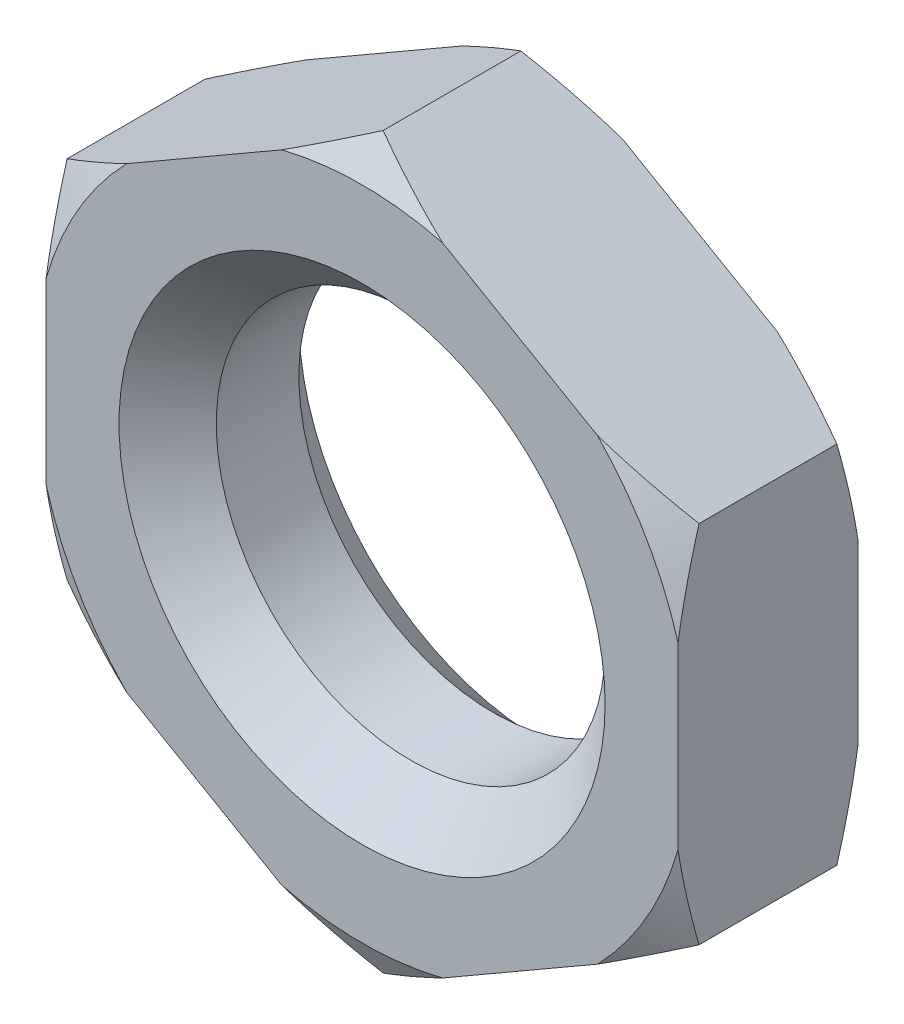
ISO-10303-21;
HEADER;
FILE_DESCRIPTION(('STEP AP214'),'2;1');
FILE_NAME('part.step','',(''),(''),'','','');
FILE_SCHEMA(('AUTOMOTIVE_DESIGN { 1 0 10303 214 1 1 1 1 }'));
ENDSEC;
DATA;
#1=APPLICATION_CONTEXT('core data for automotive mechanical design processes');
#2=APPLICATION_PROTOCOL_DEFINITION('international standard','automotive_design',2000,#1);
#3=PRODUCT_CONTEXT('',#1,'mechanical');
#4=PRODUCT('Part','Part','',(#3));
#5=PRODUCT_RELATED_PRODUCT_CATEGORY('part','',(#4));
#6=PRODUCT_DEFINITION_FORMATION('','',#4);
#7=PRODUCT_DEFINITION_CONTEXT('part definition',#1,'design');
#8=PRODUCT_DEFINITION('design','',#6,#7);
#9=PRODUCT_DEFINITION_SHAPE('','',#8);
#10=(LENGTH_UNIT() NAMED_UNIT(*) SI_UNIT(.MILLI.,.METRE.));
#11=(NAMED_UNIT(*) PLANE_ANGLE_UNIT() SI_UNIT($,.RADIAN.));
#12=(NAMED_UNIT(*) SI_UNIT($,.STERADIAN.) SOLID_ANGLE_UNIT());
#13=UNCERTAINTY_MEASURE_WITH_UNIT(LENGTH_MEASURE(1.E-05),#10,'distance_accuracy_value','');
#14=(GEOMETRIC_REPRESENTATION_CONTEXT(3) GLOBAL_UNCERTAINTY_ASSIGNED_CONTEXT((#13)) GLOBAL_UNIT_ASSIGNED_CONTEXT((#10,
#11,#12)) REPRESENTATION_CONTEXT('',''));
#15=CARTESIAN_POINT('',(0.,0.,0.));
#16=DIRECTION('',(0.,0.,1.));
#17=DIRECTION('',(1.,0.,0.));
#18=AXIS2_PLACEMENT_3D('',#15,#16,#17);
#19=CARTESIAN_POINT('',(0.,0.,-1.85));
#20=DIRECTION('',(0.,0.,1.));
#21=DIRECTION('',(1.,0.,0.));
#22=AXIS2_PLACEMENT_3D('',#19,#20,#21);
#23=PLANE('',#22);
#24=CARTESIAN_POINT('',(0.,0.,-1.85));
#25=DIRECTION('',(0.,0.,1.));
#26=DIRECTION('',(1.,0.,0.));
#27=AXIS2_PLACEMENT_3D('',#24,#25,#26);
#28=CIRCLE('',#27,5.);
#29=CARTESIAN_POINT('',(5.,0.,-1.85));
#30=VERTEX_POINT('',#29);
#31=EDGE_CURVE('E429',#30,#30,#28,.T.);
#32=ORIENTED_EDGE('',*,*,#31,.T.);
#33=EDGE_LOOP('',(#32));
#34=FACE_BOUND('',#33,.T.);
#35=DIRECTION('',(0.,1.,0.));
#36=VECTOR('',#35,1.);
#37=CARTESIAN_POINT('',(6.5,-3.75277674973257,-1.85));
#38=LINE('',#37,#36);
#39=CARTESIAN_POINT('',(6.5,-1.8405170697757,-1.85));
#40=VERTEX_POINT('',#39);
#41=CARTESIAN_POINT('',(6.5,1.8405170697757,-1.85));
#42=VERTEX_POINT('',#41);
#43=EDGE_CURVE('E364',#40,#42,#38,.T.);
#44=ORIENTED_EDGE('',*,*,#43,.F.);
#45=CARTESIAN_POINT('',(0.,0.,-1.85));
#46=DIRECTION('',(0.,0.,-1.));
#47=DIRECTION('',(-1.,0.,0.));
#48=AXIS2_PLACEMENT_3D('',#45,#46,#47);
#49=CIRCLE('',#48,6.75555349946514);
#50=CARTESIAN_POINT('',(4.84393453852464,-4.70890658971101,-1.85));
#51=VERTEX_POINT('',#50);
#52=EDGE_CURVE('E352',#40,#51,#49,.T.);
#53=ORIENTED_EDGE('',*,*,#52,.T.);
#54=DIRECTION('',(0.866025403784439,0.5,0.));
#55=VECTOR('',#54,1.);
#56=CARTESIAN_POINT('',(0.,-7.50555349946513,-1.85));
#57=LINE('',#56,#55);
#58=CARTESIAN_POINT('',(1.65606546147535,-6.5494236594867,-1.85));
#59=VERTEX_POINT('',#58);
#60=EDGE_CURVE('E374',#59,#51,#57,.T.);
#61=ORIENTED_EDGE('',*,*,#60,.F.);
#62=CARTESIAN_POINT('',(-1.65606546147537,-6.54942365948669,-1.85));
#63=VERTEX_POINT('',#62);
#64=EDGE_CURVE('E346',#59,#63,#49,.T.);
#65=ORIENTED_EDGE('',*,*,#64,.T.);
#66=DIRECTION('',(0.866025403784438,-0.5,0.));
#67=VECTOR('',#66,1.);
#68=CARTESIAN_POINT('',(-6.5,-3.75277674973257,-1.85));
#69=LINE('',#68,#67);
#70=CARTESIAN_POINT('',(-4.84393453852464,-4.70890658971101,-1.85));
#71=VERTEX_POINT('',#70);
#72=EDGE_CURVE('E380',#71,#63,#69,.T.);
#73=ORIENTED_EDGE('',*,*,#72,.F.);
#74=CARTESIAN_POINT('',(-6.5,-1.84051706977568,-1.85));
#75=VERTEX_POINT('',#74);
#76=EDGE_CURVE('E340',#71,#75,#49,.T.);
#77=ORIENTED_EDGE('',*,*,#76,.T.);
#78=DIRECTION('',(0.,-1.,0.));
#79=VECTOR('',#78,1.);
#80=CARTESIAN_POINT('',(-6.5,3.75277674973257,-1.85));
#81=LINE('',#80,#79);
#82=CARTESIAN_POINT('',(-6.5,1.84051706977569,-1.85));
#83=VERTEX_POINT('',#82);
#84=EDGE_CURVE('E476',#83,#75,#81,.T.);
#85=ORIENTED_EDGE('',*,*,#84,.F.);
#86=CARTESIAN_POINT('',(-4.84393453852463,4.70890658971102,-1.85));
#87=VERTEX_POINT('',#86);
#88=EDGE_CURVE('E63',#83,#87,#49,.T.);
#89=ORIENTED_EDGE('',*,*,#88,.T.);
#90=DIRECTION('',(-0.866025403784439,-0.5,0.));
#91=VECTOR('',#90,1.);
#92=CARTESIAN_POINT('',(0.,7.50555349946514,-1.85));
#93=LINE('',#92,#91);
#94=CARTESIAN_POINT('',(-1.65606546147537,6.54942365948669,-1.85));
#95=VERTEX_POINT('',#94);
#96=EDGE_CURVE('E181',#95,#87,#93,.T.);
#97=ORIENTED_EDGE('',*,*,#96,.F.);
#98=CARTESIAN_POINT('',(1.65606546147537,6.54942365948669,-1.85));
#99=VERTEX_POINT('',#98);
#100=EDGE_CURVE('E55',#95,#99,#49,.T.);
#101=ORIENTED_EDGE('',*,*,#100,.T.);
#102=DIRECTION('',(-0.866025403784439,0.5,0.));
#103=VECTOR('',#102,1.);
#104=CARTESIAN_POINT('',(6.49999999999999,3.75277674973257,-1.85));
#105=LINE('',#104,#103);
#106=CARTESIAN_POINT('',(4.84393453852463,4.70890658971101,-1.85));
#107=VERTEX_POINT('',#106);
#108=EDGE_CURVE('E365',#107,#99,#105,.T.);
#109=ORIENTED_EDGE('',*,*,#108,.F.);
#110=EDGE_CURVE('E343',#107,#42,#49,.T.);
#111=ORIENTED_EDGE('',*,*,#110,.T.);
#112=EDGE_LOOP('',(#44,#53,#61,#65,#73,#77,#85,#89,#97,#101,#109,#111));
#113=FACE_BOUND('',#112,.T.);
#114=ADVANCED_FACE('F39',(#34,#113),#23,.F.);
#115=CARTESIAN_POINT('',(0.,0.,1.85));
#116=DIRECTION('',(0.,0.,1.));
#117=DIRECTION('',(1.,0.,0.));
#118=AXIS2_PLACEMENT_3D('',#115,#116,#117);
#119=PLANE('',#118);
#120=CARTESIAN_POINT('',(0.,0.,1.85));
#121=DIRECTION('',(0.,0.,1.));
#122=DIRECTION('',(1.,0.,0.));
#123=AXIS2_PLACEMENT_3D('',#120,#121,#122);
#124=CIRCLE('',#123,5.00000000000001);
#125=CARTESIAN_POINT('',(5.00000000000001,0.,1.85));
#126=VERTEX_POINT('',#125);
#127=EDGE_CURVE('E11',#126,#126,#124,.F.);
#128=ORIENTED_EDGE('',*,*,#127,.T.);
#129=EDGE_LOOP('',(#128));
#130=FACE_BOUND('',#129,.T.);
#131=CARTESIAN_POINT('',(0.,0.,1.85));
#132=DIRECTION('',(0.,0.,-1.));
#133=DIRECTION('',(-1.,0.,0.));
#134=AXIS2_PLACEMENT_3D('',#131,#132,#133);
#135=CIRCLE('',#134,6.75555349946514);
#136=CARTESIAN_POINT('',(6.5,-1.84051706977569,1.85));
#137=VERTEX_POINT('',#136);
#138=CARTESIAN_POINT('',(4.84393453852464,-4.70890658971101,1.85));
#139=VERTEX_POINT('',#138);
#140=EDGE_CURVE('E314',#137,#139,#135,.T.);
#141=ORIENTED_EDGE('',*,*,#140,.F.);
#142=DIRECTION('',(0.,1.,0.));
#143=VECTOR('',#142,1.);
#144=CARTESIAN_POINT('',(6.5,-3.75277674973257,1.85));
#145=LINE('',#144,#143);
#146=CARTESIAN_POINT('',(6.49999999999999,1.8405170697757,1.85));
#147=VERTEX_POINT('',#146);
#148=EDGE_CURVE('E388',#137,#147,#145,.T.);
#149=ORIENTED_EDGE('',*,*,#148,.T.);
#150=CARTESIAN_POINT('',(4.84393453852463,4.70890658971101,1.85));
#151=VERTEX_POINT('',#150);
#152=EDGE_CURVE('E306',#151,#147,#135,.T.);
#153=ORIENTED_EDGE('',*,*,#152,.F.);
#154=DIRECTION('',(-0.866025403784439,0.5,0.));
#155=VECTOR('',#154,1.);
#156=CARTESIAN_POINT('',(6.49999999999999,3.75277674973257,1.85));
#157=LINE('',#156,#155);
#158=CARTESIAN_POINT('',(1.65606546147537,6.54942365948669,1.85));
#159=VERTEX_POINT('',#158);
#160=EDGE_CURVE('E373',#151,#159,#157,.T.);
#161=ORIENTED_EDGE('',*,*,#160,.T.);
#162=CARTESIAN_POINT('',(-1.65606546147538,6.54942365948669,1.85));
#163=VERTEX_POINT('',#162);
#164=EDGE_CURVE('E297',#163,#159,#135,.T.);
#165=ORIENTED_EDGE('',*,*,#164,.F.);
#166=DIRECTION('',(-0.866025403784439,-0.5,0.));
#167=VECTOR('',#166,1.);
#168=CARTESIAN_POINT('',(0.,7.50555349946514,1.85));
#169=LINE('',#168,#167);
#170=CARTESIAN_POINT('',(-4.84393453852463,4.70890658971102,1.85));
#171=VERTEX_POINT('',#170);
#172=EDGE_CURVE('E378',#163,#171,#169,.T.);
#173=ORIENTED_EDGE('',*,*,#172,.T.);
#174=CARTESIAN_POINT('',(-6.5,1.84051706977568,1.85));
#175=VERTEX_POINT('',#174);
#176=EDGE_CURVE('E295',#175,#171,#135,.T.);
#177=ORIENTED_EDGE('',*,*,#176,.F.);
#178=DIRECTION('',(0.,-1.,0.));
#179=VECTOR('',#178,1.);
#180=CARTESIAN_POINT('',(-6.5,3.75277674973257,1.85));
#181=LINE('',#180,#179);
#182=CARTESIAN_POINT('',(-6.5,-1.84051706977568,1.85));
#183=VERTEX_POINT('',#182);
#184=EDGE_CURVE('E480',#175,#183,#181,.T.);
#185=ORIENTED_EDGE('',*,*,#184,.T.);
#186=CARTESIAN_POINT('',(-4.84393453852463,-4.70890658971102,1.85));
#187=VERTEX_POINT('',#186);
#188=EDGE_CURVE('E298',#187,#183,#135,.T.);
#189=ORIENTED_EDGE('',*,*,#188,.F.);
#190=DIRECTION('',(0.866025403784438,-0.5,0.));
#191=VECTOR('',#190,1.);
#192=CARTESIAN_POINT('',(-6.5,-3.75277674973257,1.85));
#193=LINE('',#192,#191);
#194=CARTESIAN_POINT('',(-1.65606546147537,-6.54942365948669,1.85));
#195=VERTEX_POINT('',#194);
#196=EDGE_CURVE('E467',#187,#195,#193,.T.);
#197=ORIENTED_EDGE('',*,*,#196,.T.);
#198=CARTESIAN_POINT('',(1.65606546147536,-6.54942365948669,1.85));
#199=VERTEX_POINT('',#198);
#200=EDGE_CURVE('E308',#199,#195,#135,.T.);
#201=ORIENTED_EDGE('',*,*,#200,.F.);
#202=DIRECTION('',(0.866025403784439,0.5,0.));
#203=VECTOR('',#202,1.);
#204=CARTESIAN_POINT('',(0.,-7.50555349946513,1.85));
#205=LINE('',#204,#203);
#206=EDGE_CURVE('E465',#199,#139,#205,.T.);
#207=ORIENTED_EDGE('',*,*,#206,.T.);
#208=EDGE_LOOP('',(#141,#149,#153,#161,#165,#173,#177,#185,#189,#197,#201,#207));
#209=FACE_BOUND('',#208,.T.);
#210=ADVANCED_FACE('F420',(#130,#209),#119,.T.);
#211=CARTESIAN_POINT('',(6.49999999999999,3.75277674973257,1.85));
#212=DIRECTION('',(-0.5,-0.866025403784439,0.));
#213=DIRECTION('',(0.866025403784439,-0.5,0.));
#214=AXIS2_PLACEMENT_3D('',#211,#212,#213);
#215=PLANE('',#214);
#216=DIRECTION('',(0.,0.,-1.));
#217=VECTOR('',#216,1.);
#218=CARTESIAN_POINT('',(6.49999999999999,3.75277674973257,1.85));
#219=LINE('',#218,#217);
#220=CARTESIAN_POINT('',(6.49999999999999,3.75277674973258,1.41698729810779));
#221=VERTEX_POINT('',#220);
#222=CARTESIAN_POINT('',(6.49999999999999,3.75277674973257,-1.41698729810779));
#223=VERTEX_POINT('',#222);
#224=EDGE_CURVE('E384',#221,#223,#219,.T.);
#225=ORIENTED_EDGE('',*,*,#224,.T.);
#226=CARTESIAN_POINT('',(11.0110203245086,1.14833795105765,0.641373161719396));
#227=CARTESIAN_POINT('',(10.8068099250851,1.26623888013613,0.531192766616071));
#228=CARTESIAN_POINT('',(10.6021106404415,1.38442206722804,0.422201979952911));
#229=CARTESIAN_POINT('',(10.1915281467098,1.62147198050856,0.207158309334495));
#230=CARTESIAN_POINT('',(9.98564479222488,1.74033879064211,0.101105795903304));
#231=CARTESIAN_POINT('',(9.571875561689,1.97922856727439,-0.107809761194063));
#232=CARTESIAN_POINT('',(9.36398537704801,2.09925402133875,-0.210661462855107));
#233=CARTESIAN_POINT('',(8.94664688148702,2.34020451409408,-0.412050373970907));
#234=CARTESIAN_POINT('',(8.73719862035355,2.46112952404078,-0.510587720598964));
#235=CARTESIAN_POINT('',(8.31115395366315,2.7071065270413,-0.704838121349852));
#236=CARTESIAN_POINT('',(8.09451108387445,2.83218534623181,-0.800415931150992));
#237=CARTESIAN_POINT('',(7.65903949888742,3.08360498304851,-0.984757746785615));
#238=CARTESIAN_POINT('',(7.44021067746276,3.20994586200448,-1.07352141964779));
#239=CARTESIAN_POINT('',(7.00031668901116,3.46391877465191,-1.24254400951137));
#240=CARTESIAN_POINT('',(6.77925390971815,3.59154942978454,-1.32281113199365));
#241=CARTESIAN_POINT('',(6.33453294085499,3.84830920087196,-1.47298661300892));
#242=CARTESIAN_POINT('',(6.11087509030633,3.97743812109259,-1.54289630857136));
#243=CARTESIAN_POINT('',(5.57596355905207,4.28626943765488,-1.69410339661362));
#244=CARTESIAN_POINT('',(5.26346342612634,4.46669147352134,-1.76976341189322));
#245=CARTESIAN_POINT('',(4.79151101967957,4.73917332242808,-1.86067422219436));
#246=CARTESIAN_POINT('',(4.63366251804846,4.83030719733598,-1.88721436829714));
#247=CARTESIAN_POINT('',(4.31710107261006,5.01307403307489,-1.93210055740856));
#248=CARTESIAN_POINT('',(4.15838824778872,5.10470692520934,-1.95044770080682));
#249=CARTESIAN_POINT('',(3.84221887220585,5.28724739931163,-1.97826240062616));
#250=CARTESIAN_POINT('',(3.68476895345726,5.37815115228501,-1.98782996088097));
#251=CARTESIAN_POINT('',(3.36965185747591,5.56008409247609,-1.99816242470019));
#252=CARTESIAN_POINT('',(3.21198468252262,5.65111327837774,-1.99892741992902));
#253=CARTESIAN_POINT('',(2.89680500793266,5.83308234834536,-1.99163038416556));
#254=CARTESIAN_POINT('',(2.73929250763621,5.92402223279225,-1.98356839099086));
#255=CARTESIAN_POINT('',(2.42475712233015,6.10561932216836,-1.95886134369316));
#256=CARTESIAN_POINT('',(2.26773431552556,6.1962764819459,-1.9422149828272));
#257=CARTESIAN_POINT('',(1.89672720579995,6.41047753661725,-1.89316398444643));
#258=CARTESIAN_POINT('',(1.68309197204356,6.53381989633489,-1.85721186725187));
#259=CARTESIAN_POINT('',(1.25786747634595,6.77932337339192,-1.77177082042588));
#260=CARTESIAN_POINT('',(1.04627851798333,6.90148431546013,-1.72227991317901));
#261=CARTESIAN_POINT('',(0.625172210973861,7.1446101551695,-1.61162970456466));
#262=CARTESIAN_POINT('',(0.415657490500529,7.26557353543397,-1.55045720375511));
#263=CARTESIAN_POINT('',(-0.00101965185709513,7.50614219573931,-1.41837084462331));
#264=CARTESIAN_POINT('',(-0.208182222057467,7.62574756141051,-1.34745760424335));
#265=CARTESIAN_POINT('',(-0.622750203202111,7.86509849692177,-1.19668221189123));
#266=CARTESIAN_POINT('',(-0.830129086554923,7.98482875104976,-1.11672348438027));
#267=CARTESIAN_POINT('',(-1.2426899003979,8.22302084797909,-0.950096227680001));
#268=CARTESIAN_POINT('',(-1.44787318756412,8.34148347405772,-0.863432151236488));
#269=CARTESIAN_POINT('',(-1.85636986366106,8.57732913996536,-0.684583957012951));
#270=CARTESIAN_POINT('',(-2.05968363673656,8.69471240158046,-0.592401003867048));
#271=CARTESIAN_POINT('',(-2.46471740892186,8.92855875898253,-0.40348115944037));
#272=CARTESIAN_POINT('',(-2.66643737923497,9.04502183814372,-0.306744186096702));
#273=CARTESIAN_POINT('',(-3.00631213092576,9.24124861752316,-0.140007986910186));
#274=CARTESIAN_POINT('',(-3.14483053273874,9.3212222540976,-0.0709928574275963));
#275=CARTESIAN_POINT('',(-3.42126306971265,9.48082065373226,0.0686181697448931));
#276=CARTESIAN_POINT('',(-3.55917722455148,9.56044542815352,0.139214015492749));
#277=CARTESIAN_POINT('',(-3.83301759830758,9.71854724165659,0.281052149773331));
#278=CARTESIAN_POINT('',(-3.96894948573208,9.79702755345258,0.352279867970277));
#279=CARTESIAN_POINT('',(-4.2403332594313,9.95371104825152,0.495951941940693));
#280=CARTESIAN_POINT('',(-4.37578513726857,10.0319142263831,0.568396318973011));
#281=CARTESIAN_POINT('',(-4.51102032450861,10.1099922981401,0.641373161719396));
#282=B_SPLINE_CURVE_WITH_KNOTS('',3,(#226,#227,#228,#229,#230,#231,#232,#233,#234,#235,#236,
#237,#238,#239,#240,#241,#242,#243,#244,#245,#246,#247,#248,#249,#250,#251,#252,#253,#254,#255,
#256,#257,#258,#259,#260,#261,#262,#263,#264,#265,#266,#267,#268,#269,#270,#271,#272,#273,#274,
#275,#276,#277,#278,#279,#280,#281),.UNSPECIFIED.,.F.,.F.,(4,2,2,2,2,2,2,2,2,2,2,2,2,2,2,2,2,2,
2,2,2,2,2,2,2,2,2,4),(0.,0.780828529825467,1.56175508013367,2.34519063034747,3.12860125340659,
3.9319039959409,4.73524596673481,5.53780489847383,6.3402601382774,7.44513114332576,
7.99754815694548,8.54989095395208,9.09586123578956,9.64182583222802,10.1877880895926,
10.7338334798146,11.4812535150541,12.228782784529,12.977161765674,13.7254932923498,
14.4827429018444,15.239493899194,15.9960857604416,16.7526912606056,17.2752879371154,
17.7978674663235,18.3149600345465,18.832061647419),.UNSPECIFIED.);
#283=EDGE_CURVE('E318',#223,#107,#282,.T.);
#284=ORIENTED_EDGE('',*,*,#283,.T.);
#285=ORIENTED_EDGE('',*,*,#108,.T.);
#286=CARTESIAN_POINT('',(0.,7.50555349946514,-1.41698729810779));
#287=VERTEX_POINT('',#286);
#288=EDGE_CURVE('E309',#99,#287,#282,.T.);
#289=ORIENTED_EDGE('',*,*,#288,.T.);
#290=DIRECTION('',(0.,0.,-1.));
#291=VECTOR('',#290,1.);
#292=CARTESIAN_POINT('',(0.,7.50555349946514,1.85));
#293=LINE('',#292,#291);
#294=CARTESIAN_POINT('',(0.,7.50555349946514,1.41698729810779));
#295=VERTEX_POINT('',#294);
#296=EDGE_CURVE('E190',#295,#287,#293,.T.);
#297=ORIENTED_EDGE('',*,*,#296,.F.);
#298=CARTESIAN_POINT('',(-4.51102032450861,10.1099922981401,-0.641373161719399));
#299=CARTESIAN_POINT('',(-4.30680992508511,9.99209136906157,-0.531192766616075));
#300=CARTESIAN_POINT('',(-4.10211064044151,9.87390818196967,-0.422201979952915));
#301=CARTESIAN_POINT('',(-3.69152814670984,9.63685826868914,-0.207158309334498));
#302=CARTESIAN_POINT('',(-3.48564479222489,9.51799145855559,-0.101105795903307));
#303=CARTESIAN_POINT('',(-3.071875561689,9.27910168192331,0.107809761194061));
#304=CARTESIAN_POINT('',(-2.86398537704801,9.15907622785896,0.210661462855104));
#305=CARTESIAN_POINT('',(-2.44664688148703,8.91812573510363,0.412050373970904));
#306=CARTESIAN_POINT('',(-2.23719862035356,8.79720072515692,0.51058772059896));
#307=CARTESIAN_POINT('',(-1.81115395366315,8.55122372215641,0.704838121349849));
#308=CARTESIAN_POINT('',(-1.59451108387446,8.42614490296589,0.800415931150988));
#309=CARTESIAN_POINT('',(-1.15903949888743,8.1747252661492,0.984757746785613));
#310=CARTESIAN_POINT('',(-0.94021067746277,8.04838438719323,1.07352141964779));
#311=CARTESIAN_POINT('',(-0.500316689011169,7.7944114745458,1.24254400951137));
#312=CARTESIAN_POINT('',(-0.279253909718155,7.66678081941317,1.32281113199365));
#313=CARTESIAN_POINT('',(0.165467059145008,7.41002104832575,1.47298661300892));
#314=CARTESIAN_POINT('',(0.38912490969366,7.28089212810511,1.54289630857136));
#315=CARTESIAN_POINT('',(0.924036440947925,6.97206081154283,1.69410339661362));
#316=CARTESIAN_POINT('',(1.23653657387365,6.79163877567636,1.76976341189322));
#317=CARTESIAN_POINT('',(1.70848898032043,6.51915692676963,1.86067422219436));
#318=CARTESIAN_POINT('',(1.86633748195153,6.42802305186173,1.88721436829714));
#319=CARTESIAN_POINT('',(2.18289892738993,6.24525621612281,1.93210055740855));
#320=CARTESIAN_POINT('',(2.34161175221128,6.15362332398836,1.95044770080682));
#321=CARTESIAN_POINT('',(2.65778112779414,5.97108284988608,1.97826240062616));
#322=CARTESIAN_POINT('',(2.81523104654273,5.8801790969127,1.98782996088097));
#323=CARTESIAN_POINT('',(3.13034814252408,5.69824615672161,1.99816242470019));
#324=CARTESIAN_POINT('',(3.28801531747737,5.60721697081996,1.99892741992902));
#325=CARTESIAN_POINT('',(3.60319499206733,5.42524790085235,1.99163038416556));
#326=CARTESIAN_POINT('',(3.76070749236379,5.33430801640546,1.98356839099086));
#327=CARTESIAN_POINT('',(4.07524287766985,5.15271092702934,1.95886134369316));
#328=CARTESIAN_POINT('',(4.23226568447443,5.06205376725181,1.9422149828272));
#329=CARTESIAN_POINT('',(4.60327279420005,4.84785271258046,1.89316398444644));
#330=CARTESIAN_POINT('',(4.81690802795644,4.72451035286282,1.85721186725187));
#331=CARTESIAN_POINT('',(5.24213252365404,4.47900687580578,1.77177082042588));
#332=CARTESIAN_POINT('',(5.45372148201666,4.35684593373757,1.72227991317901));
#333=CARTESIAN_POINT('',(5.87482778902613,4.11372009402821,1.61162970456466));
#334=CARTESIAN_POINT('',(6.08434250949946,3.99275671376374,1.55045720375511));
#335=CARTESIAN_POINT('',(6.50101965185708,3.7521880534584,1.41837084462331));
#336=CARTESIAN_POINT('',(6.70818222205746,3.6325826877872,1.34745760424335));
#337=CARTESIAN_POINT('',(7.1227502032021,3.39323175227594,1.19668221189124));
#338=CARTESIAN_POINT('',(7.33012908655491,3.27350149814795,1.11672348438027));
#339=CARTESIAN_POINT('',(7.74268990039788,3.03530940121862,0.950096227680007));
#340=CARTESIAN_POINT('',(7.94787318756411,2.91684677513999,0.863432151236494));
#341=CARTESIAN_POINT('',(8.35636986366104,2.68100110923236,0.684583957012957));
#342=CARTESIAN_POINT('',(8.55968363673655,2.56361784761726,0.592401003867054));
#343=CARTESIAN_POINT('',(8.96471740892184,2.32977149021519,0.403481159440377));
#344=CARTESIAN_POINT('',(9.16643737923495,2.21330841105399,0.306744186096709));
#345=CARTESIAN_POINT('',(9.50631213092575,2.01708163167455,0.140007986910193));
#346=CARTESIAN_POINT('',(9.64483053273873,1.93710799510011,0.0709928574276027));
#347=CARTESIAN_POINT('',(9.92126306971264,1.77750959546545,-0.0686181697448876));
#348=CARTESIAN_POINT('',(10.0591772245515,1.69788482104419,-0.139214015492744));
#349=CARTESIAN_POINT('',(10.3330175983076,1.53978300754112,-0.281052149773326));
#350=CARTESIAN_POINT('',(10.4689494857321,1.46130269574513,-0.352279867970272));
#351=CARTESIAN_POINT('',(10.7403332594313,1.30461920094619,-0.495951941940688));
#352=CARTESIAN_POINT('',(10.8757851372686,1.2264160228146,-0.568396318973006));
#353=CARTESIAN_POINT('',(11.0110203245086,1.14833795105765,-0.641373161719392));
#354=B_SPLINE_CURVE_WITH_KNOTS('',3,(#298,#299,#300,#301,#302,#303,#304,#305,#306,#307,#308,
#309,#310,#311,#312,#313,#314,#315,#316,#317,#318,#319,#320,#321,#322,#323,#324,#325,#326,#327,
#328,#329,#330,#331,#332,#333,#334,#335,#336,#337,#338,#339,#340,#341,#342,#343,#344,#345,#346,
#347,#348,#349,#350,#351,#352,#353),.UNSPECIFIED.,.F.,.F.,(4,2,2,2,2,2,2,2,2,2,2,2,2,2,2,2,2,2,
2,2,2,2,2,2,2,2,2,4),(0.,0.780828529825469,1.56175508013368,2.34519063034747,3.12860125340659,
3.9319039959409,4.73524596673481,5.53780489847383,6.3402601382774,7.44513114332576,
7.99754815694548,8.54989095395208,9.09586123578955,9.64182583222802,10.1877880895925,
10.7338334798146,11.4812535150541,12.228782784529,12.977161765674,13.7254932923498,
14.4827429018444,15.239493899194,15.9960857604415,16.7526912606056,17.2752879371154,
17.7978674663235,18.3149600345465,18.832061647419),.UNSPECIFIED.);
#355=EDGE_CURVE('E473',#295,#159,#354,.T.);
#356=ORIENTED_EDGE('',*,*,#355,.T.);
#357=ORIENTED_EDGE('',*,*,#160,.F.);
#358=EDGE_CURVE('E248',#151,#221,#354,.T.);
#359=ORIENTED_EDGE('',*,*,#358,.T.);
#360=EDGE_LOOP('',(#225,#284,#285,#289,#297,#356,#357,#359));
#361=FACE_BOUND('',#360,.T.);
#362=ADVANCED_FACE('F425',(#361),#215,.F.);
#363=CARTESIAN_POINT('',(0.,7.50555349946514,1.85));
#364=DIRECTION('',(0.5,-0.866025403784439,0.));
#365=DIRECTION('',(0.866025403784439,0.5,0.));
#366=AXIS2_PLACEMENT_3D('',#363,#364,#365);
#367=PLANE('',#366);
#368=ORIENTED_EDGE('',*,*,#296,.T.);
#369=CARTESIAN_POINT('',(4.51102032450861,10.1099922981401,0.641373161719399));
#370=CARTESIAN_POINT('',(4.3068099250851,9.99209136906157,0.531192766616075));
#371=CARTESIAN_POINT('',(4.1021106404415,9.87390818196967,0.422201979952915));
#372=CARTESIAN_POINT('',(3.69152814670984,9.63685826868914,0.207158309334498));
#373=CARTESIAN_POINT('',(3.48564479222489,9.51799145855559,0.101105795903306));
#374=CARTESIAN_POINT('',(3.071875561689,9.27910168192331,-0.107809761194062));
#375=CARTESIAN_POINT('',(2.86398537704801,9.15907622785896,-0.210661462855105));
#376=CARTESIAN_POINT('',(2.44664688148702,8.91812573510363,-0.412050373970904));
#377=CARTESIAN_POINT('',(2.23719862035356,8.79720072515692,-0.510587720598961));
#378=CARTESIAN_POINT('',(1.81115395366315,8.55122372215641,-0.70483812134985));
#379=CARTESIAN_POINT('',(1.59451108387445,8.42614490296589,-0.80041593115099));
#380=CARTESIAN_POINT('',(1.15903949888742,8.1747252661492,-0.984757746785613));
#381=CARTESIAN_POINT('',(0.940210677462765,8.04838438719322,-1.07352141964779));
#382=CARTESIAN_POINT('',(0.500316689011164,7.79441147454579,-1.24254400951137));
#383=CARTESIAN_POINT('',(0.27925390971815,7.66678081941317,-1.32281113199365));
#384=CARTESIAN_POINT('',(-0.165467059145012,7.41002104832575,-1.47298661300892));
#385=CARTESIAN_POINT('',(-0.389124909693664,7.28089212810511,-1.54289630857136));
#386=CARTESIAN_POINT('',(-0.924036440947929,6.97206081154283,-1.69410339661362));
#387=CARTESIAN_POINT('',(-1.23653657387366,6.79163877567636,-1.76976341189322));
#388=CARTESIAN_POINT('',(-1.70848898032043,6.51915692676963,-1.86067422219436));
#389=CARTESIAN_POINT('',(-1.86633748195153,6.42802305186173,-1.88721436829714));
#390=CARTESIAN_POINT('',(-2.18289892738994,6.24525621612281,-1.93210055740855));
#391=CARTESIAN_POINT('',(-2.34161175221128,6.15362332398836,-1.95044770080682));
#392=CARTESIAN_POINT('',(-2.65778112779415,5.97108284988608,-1.97826240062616));
#393=CARTESIAN_POINT('',(-2.81523104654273,5.8801790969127,-1.98782996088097));
#394=CARTESIAN_POINT('',(-3.13034814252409,5.69824615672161,-1.99816242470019));
#395=CARTESIAN_POINT('',(-3.28801531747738,5.60721697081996,-1.99892741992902));
#396=CARTESIAN_POINT('',(-3.60319499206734,5.42524790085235,-1.99163038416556));
#397=CARTESIAN_POINT('',(-3.76070749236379,5.33430801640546,-1.98356839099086));
#398=CARTESIAN_POINT('',(-4.07524287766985,5.15271092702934,-1.95886134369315));
#399=CARTESIAN_POINT('',(-4.23226568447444,5.06205376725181,-1.9422149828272));
#400=CARTESIAN_POINT('',(-4.60327279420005,4.84785271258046,-1.89316398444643));
#401=CARTESIAN_POINT('',(-4.81690802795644,4.72451035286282,-1.85721186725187));
#402=CARTESIAN_POINT('',(-5.24213252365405,4.47900687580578,-1.77177082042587));
#403=CARTESIAN_POINT('',(-5.45372148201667,4.35684593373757,-1.72227991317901));
#404=CARTESIAN_POINT('',(-5.87482778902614,4.1137200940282,-1.61162970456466));
#405=CARTESIAN_POINT('',(-6.08434250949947,3.99275671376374,-1.55045720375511));
#406=CARTESIAN_POINT('',(-6.5010196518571,3.7521880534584,-1.41837084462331));
#407=CARTESIAN_POINT('',(-6.70818222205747,3.6325826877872,-1.34745760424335));
#408=CARTESIAN_POINT('',(-7.12275020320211,3.39323175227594,-1.19668221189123));
#409=CARTESIAN_POINT('',(-7.33012908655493,3.27350149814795,-1.11672348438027));
#410=CARTESIAN_POINT('',(-7.7426899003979,3.03530940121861,-0.95009622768));
#411=CARTESIAN_POINT('',(-7.94787318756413,2.91684677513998,-0.863432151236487));
#412=CARTESIAN_POINT('',(-8.35636986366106,2.68100110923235,-0.684583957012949));
#413=CARTESIAN_POINT('',(-8.55968363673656,2.56361784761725,-0.592401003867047));
#414=CARTESIAN_POINT('',(-8.96471740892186,2.32977149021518,-0.403481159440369));
#415=CARTESIAN_POINT('',(-9.16643737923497,2.21330841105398,-0.3067441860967));
#416=CARTESIAN_POINT('',(-9.50631213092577,2.01708163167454,-0.140007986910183));
#417=CARTESIAN_POINT('',(-9.64483053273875,1.9371079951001,-0.0709928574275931));
#418=CARTESIAN_POINT('',(-9.92126306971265,1.77750959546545,0.0686181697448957));
#419=CARTESIAN_POINT('',(-10.0591772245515,1.69788482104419,0.139214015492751));
#420=CARTESIAN_POINT('',(-10.3330175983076,1.53978300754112,0.281052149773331));
#421=CARTESIAN_POINT('',(-10.4689494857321,1.46130269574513,0.352279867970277));
#422=CARTESIAN_POINT('',(-10.7403332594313,1.30461920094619,0.495951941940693));
#423=CARTESIAN_POINT('',(-10.8757851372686,1.2264160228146,0.568396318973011));
#424=CARTESIAN_POINT('',(-11.0110203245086,1.14833795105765,0.641373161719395));
#425=B_SPLINE_CURVE_WITH_KNOTS('',3,(#369,#370,#371,#372,#373,#374,#375,#376,#377,#378,#379,
#380,#381,#382,#383,#384,#385,#386,#387,#388,#389,#390,#391,#392,#393,#394,#395,#396,#397,#398,
#399,#400,#401,#402,#403,#404,#405,#406,#407,#408,#409,#410,#411,#412,#413,#414,#415,#416,#417,
#418,#419,#420,#421,#422,#423,#424),.UNSPECIFIED.,.F.,.F.,(4,2,2,2,2,2,2,2,2,2,2,2,2,2,2,2,2,2,
2,2,2,2,2,2,2,2,2,4),(0.,0.780828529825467,1.56175508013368,2.34519063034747,3.1286012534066,
3.9319039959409,4.73524596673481,5.53780489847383,6.3402601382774,7.44513114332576,
7.99754815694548,8.54989095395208,9.09586123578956,9.64182583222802,10.1877880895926,
10.7338334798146,11.4812535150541,12.228782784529,12.977161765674,13.7254932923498,
14.4827429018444,15.2394938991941,15.9960857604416,16.7526912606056,17.2752879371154,
17.7978674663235,18.3149600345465,18.832061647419),.UNSPECIFIED.);
#426=EDGE_CURVE('E183',#287,#95,#425,.T.);
#427=ORIENTED_EDGE('',*,*,#426,.T.);
#428=ORIENTED_EDGE('',*,*,#96,.T.);
#429=CARTESIAN_POINT('',(-6.5,3.75277674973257,-1.41698729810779));
#430=VERTEX_POINT('',#429);
#431=EDGE_CURVE('E165',#87,#430,#425,.T.);
#432=ORIENTED_EDGE('',*,*,#431,.T.);
#433=DIRECTION('',(0.,0.,-1.));
#434=VECTOR('',#433,1.);
#435=CARTESIAN_POINT('',(-6.5,3.75277674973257,1.85));
#436=LINE('',#435,#434);
#437=CARTESIAN_POINT('',(-6.5,3.75277674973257,1.41698729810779));
#438=VERTEX_POINT('',#437);
#439=EDGE_CURVE('E179',#438,#430,#436,.T.);
#440=ORIENTED_EDGE('',*,*,#439,.F.);
#441=CARTESIAN_POINT('',(-11.0110203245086,1.14833795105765,-0.6413731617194));
#442=CARTESIAN_POINT('',(-10.8068099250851,1.26623888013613,-0.531192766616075));
#443=CARTESIAN_POINT('',(-10.6021106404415,1.38442206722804,-0.422201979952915));
#444=CARTESIAN_POINT('',(-10.1915281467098,1.62147198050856,-0.207158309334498));
#445=CARTESIAN_POINT('',(-9.98564479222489,1.74033879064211,-0.101105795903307));
#446=CARTESIAN_POINT('',(-9.571875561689,1.97922856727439,0.10780976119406));
#447=CARTESIAN_POINT('',(-9.36398537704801,2.09925402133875,0.210661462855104));
#448=CARTESIAN_POINT('',(-8.94664688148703,2.34020451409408,0.412050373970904));
#449=CARTESIAN_POINT('',(-8.73719862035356,2.46112952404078,0.51058772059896));
#450=CARTESIAN_POINT('',(-8.31115395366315,2.7071065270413,0.704838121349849));
#451=CARTESIAN_POINT('',(-8.09451108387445,2.83218534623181,0.800415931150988));
#452=CARTESIAN_POINT('',(-7.65903949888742,3.08360498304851,0.984757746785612));
#453=CARTESIAN_POINT('',(-7.44021067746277,3.20994586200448,1.07352141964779));
#454=CARTESIAN_POINT('',(-7.00031668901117,3.46391877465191,1.24254400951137));
#455=CARTESIAN_POINT('',(-6.77925390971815,3.59154942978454,1.32281113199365));
#456=CARTESIAN_POINT('',(-6.33453294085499,3.84830920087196,1.47298661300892));
#457=CARTESIAN_POINT('',(-6.11087509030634,3.97743812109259,1.54289630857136));
#458=CARTESIAN_POINT('',(-5.57596355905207,4.28626943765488,1.69410339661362));
#459=CARTESIAN_POINT('',(-5.26346342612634,4.46669147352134,1.76976341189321));
#460=CARTESIAN_POINT('',(-4.79151101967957,4.73917332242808,1.86067422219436));
#461=CARTESIAN_POINT('',(-4.63366251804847,4.83030719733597,1.88721436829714));
#462=CARTESIAN_POINT('',(-4.31710107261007,5.01307403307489,1.93210055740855));
#463=CARTESIAN_POINT('',(-4.15838824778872,5.10470692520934,1.95044770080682));
#464=CARTESIAN_POINT('',(-3.84221887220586,5.28724739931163,1.97826240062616));
#465=CARTESIAN_POINT('',(-3.68476895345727,5.37815115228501,1.98782996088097));
#466=CARTESIAN_POINT('',(-3.36965185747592,5.56008409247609,1.99816242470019));
#467=CARTESIAN_POINT('',(-3.21198468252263,5.65111327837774,1.99892741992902));
#468=CARTESIAN_POINT('',(-2.89680500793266,5.83308234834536,1.99163038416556));
#469=CARTESIAN_POINT('',(-2.73929250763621,5.92402223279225,1.98356839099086));
#470=CARTESIAN_POINT('',(-2.42475712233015,6.10561932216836,1.95886134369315));
#471=CARTESIAN_POINT('',(-2.26773431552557,6.1962764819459,1.9422149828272));
#472=CARTESIAN_POINT('',(-1.89672720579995,6.41047753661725,1.89316398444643));
#473=CARTESIAN_POINT('',(-1.68309197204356,6.53381989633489,1.85721186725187));
#474=CARTESIAN_POINT('',(-1.25786747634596,6.77932337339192,1.77177082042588));
#475=CARTESIAN_POINT('',(-1.04627851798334,6.90148431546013,1.72227991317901));
#476=CARTESIAN_POINT('',(-0.625172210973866,7.1446101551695,1.61162970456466));
#477=CARTESIAN_POINT('',(-0.415657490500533,7.26557353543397,1.55045720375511));
#478=CARTESIAN_POINT('',(0.00101965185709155,7.50614219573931,1.41837084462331));
#479=CARTESIAN_POINT('',(0.208182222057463,7.62574756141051,1.34745760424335));
#480=CARTESIAN_POINT('',(0.622750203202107,7.86509849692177,1.19668221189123));
#481=CARTESIAN_POINT('',(0.830129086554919,7.98482875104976,1.11672348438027));
#482=CARTESIAN_POINT('',(1.24268990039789,8.22302084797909,0.950096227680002));
#483=CARTESIAN_POINT('',(1.44787318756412,8.34148347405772,0.863432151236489));
#484=CARTESIAN_POINT('',(1.85636986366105,8.57732913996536,0.684583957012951));
#485=CARTESIAN_POINT('',(2.05968363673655,8.69471240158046,0.592401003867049));
#486=CARTESIAN_POINT('',(2.46471740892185,8.92855875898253,0.403481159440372));
#487=CARTESIAN_POINT('',(2.66643737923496,9.04502183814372,0.306744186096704));
#488=CARTESIAN_POINT('',(3.00631213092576,9.24124861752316,0.140007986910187));
#489=CARTESIAN_POINT('',(3.14483053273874,9.3212222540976,0.0709928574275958));
#490=CARTESIAN_POINT('',(3.42126306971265,9.48082065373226,-0.0686181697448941));
#491=CARTESIAN_POINT('',(3.55917722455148,9.56044542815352,-0.139214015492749));
#492=CARTESIAN_POINT('',(3.83301759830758,9.71854724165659,-0.28105214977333));
#493=CARTESIAN_POINT('',(3.96894948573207,9.79702755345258,-0.352279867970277));
#494=CARTESIAN_POINT('',(4.2403332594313,9.95371104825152,-0.495951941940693));
#495=CARTESIAN_POINT('',(4.37578513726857,10.0319142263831,-0.568396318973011));
#496=CARTESIAN_POINT('',(4.51102032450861,10.1099922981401,-0.641373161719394));
#497=B_SPLINE_CURVE_WITH_KNOTS('',3,(#441,#442,#443,#444,#445,#446,#447,#448,#449,#450,#451,
#452,#453,#454,#455,#456,#457,#458,#459,#460,#461,#462,#463,#464,#465,#466,#467,#468,#469,#470,
#471,#472,#473,#474,#475,#476,#477,#478,#479,#480,#481,#482,#483,#484,#485,#486,#487,#488,#489,
#490,#491,#492,#493,#494,#495,#496),.UNSPECIFIED.,.F.,.F.,(4,2,2,2,2,2,2,2,2,2,2,2,2,2,2,2,2,2,
2,2,2,2,2,2,2,2,2,4),(0.,0.780828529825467,1.56175508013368,2.34519063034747,3.12860125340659,
3.9319039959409,4.73524596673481,5.53780489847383,6.3402601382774,7.44513114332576,
7.99754815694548,8.54989095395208,9.09586123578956,9.64182583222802,10.1877880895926,
10.7338334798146,11.4812535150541,12.228782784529,12.977161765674,13.7254932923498,
14.4827429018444,15.239493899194,15.9960857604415,16.7526912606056,17.2752879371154,
17.7978674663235,18.3149600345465,18.832061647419),.UNSPECIFIED.);
#498=EDGE_CURVE('E268',#438,#171,#497,.T.);
#499=ORIENTED_EDGE('',*,*,#498,.T.);
#500=ORIENTED_EDGE('',*,*,#172,.F.);
#501=EDGE_CURVE('E490',#163,#295,#497,.T.);
#502=ORIENTED_EDGE('',*,*,#501,.T.);
#503=EDGE_LOOP('',(#368,#427,#428,#432,#440,#499,#500,#502));
#504=FACE_BOUND('',#503,.T.);
#505=ADVANCED_FACE('F177',(#504),#367,.F.);
#506=CARTESIAN_POINT('',(-6.5,3.75277674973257,1.85));
#507=DIRECTION('',(1.,0.,0.));
#508=DIRECTION('',(0.,1.,0.));
#509=AXIS2_PLACEMENT_3D('',#506,#507,#508);
#510=PLANE('',#509);
#511=ORIENTED_EDGE('',*,*,#439,.T.);
#512=CARTESIAN_POINT('',(-6.5,8.26379707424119,0.3198342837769));
#513=CARTESIAN_POINT('',(-6.5,8.02897888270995,0.213303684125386));
#514=CARTESIAN_POINT('',(-6.5,7.79351810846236,0.108162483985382));
#515=CARTESIAN_POINT('',(-6.5,7.32103613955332,-0.0986669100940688));
#516=CARTESIAN_POINT('',(-6.5,7.08401467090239,-0.200354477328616));
#517=CARTESIAN_POINT('',(-6.5,6.60722612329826,-0.399979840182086));
#518=CARTESIAN_POINT('',(-6.5,6.36745170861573,-0.497900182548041));
#519=CARTESIAN_POINT('',(-6.5,5.88587525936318,-0.688608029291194));
#520=CARTESIAN_POINT('',(-6.5,5.64407331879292,-0.78139577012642));
#521=CARTESIAN_POINT('',(-6.5,5.15923562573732,-0.960292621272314));
#522=CARTESIAN_POINT('',(-6.5,4.91621032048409,-1.0464299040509));
#523=CARTESIAN_POINT('',(-6.5,4.42756153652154,-1.21108648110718));
#524=CARTESIAN_POINT('',(-6.5,4.18193792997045,-1.28960539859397));
#525=CARTESIAN_POINT('',(-6.5,3.68822158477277,-1.43722235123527));
#526=CARTESIAN_POINT('',(-6.5,3.44013268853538,-1.50633314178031));
#527=CARTESIAN_POINT('',(-6.5,2.94106058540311,-1.63329487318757));
#528=CARTESIAN_POINT('',(-6.5,2.69007750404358,-1.69114630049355));
#529=CARTESIAN_POINT('',(-6.5,2.25677507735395,-1.77899308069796));
#530=CARTESIAN_POINT('',(-6.5,2.07511447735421,-1.8122391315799));
#531=CARTESIAN_POINT('',(-6.5,1.71057716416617,-1.87108244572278));
#532=CARTESIAN_POINT('',(-6.5,1.52770065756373,-1.89668097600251));
#533=CARTESIAN_POINT('',(-6.5,1.16100156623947,-1.9395594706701));
#534=CARTESIAN_POINT('',(-6.5,0.977179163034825,-1.95684097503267));
#535=CARTESIAN_POINT('',(-6.5,0.608912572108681,-1.98259035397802));
#536=CARTESIAN_POINT('',(-6.5,0.424468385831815,-1.99105824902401));
#537=CARTESIAN_POINT('',(-6.5,0.0554782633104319,-1.99891618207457));
#538=CARTESIAN_POINT('',(-6.5,-0.129067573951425,-1.9983108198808));
#539=CARTESIAN_POINT('',(-6.5,-0.497903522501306,-1.98805308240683));
#540=CARTESIAN_POINT('',(-6.5,-0.682193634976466,-1.97840074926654));
#541=CARTESIAN_POINT('',(-6.5,-1.05010954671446,-1.95034347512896));
#542=CARTESIAN_POINT('',(-6.5,-1.23373532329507,-1.93193823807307));
#543=CARTESIAN_POINT('',(-6.5,-1.59998932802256,-1.88690646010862));
#544=CARTESIAN_POINT('',(-6.5,-1.78261736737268,-1.86027841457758));
#545=CARTESIAN_POINT('',(-6.5,-2.509890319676,-1.73877949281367));
#546=CARTESIAN_POINT('',(-6.5,-3.04964366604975,-1.61377048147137));
#547=CARTESIAN_POINT('',(-6.5,-3.84931035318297,-1.39095239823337));
#548=CARTESIAN_POINT('',(-6.5,-4.11455078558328,-1.31066548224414));
#549=CARTESIAN_POINT('',(-6.5,-4.64197567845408,-1.1405419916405));
#550=CARTESIAN_POINT('',(-6.5,-4.90416035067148,-1.05070608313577));
#551=CARTESIAN_POINT('',(-6.5,-5.42871096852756,-0.86230037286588));
#552=CARTESIAN_POINT('',(-6.5,-5.69104494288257,-0.763642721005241));
#553=CARTESIAN_POINT('',(-6.5,-6.2132661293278,-0.560020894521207));
#554=CARTESIAN_POINT('',(-6.5,-6.47315318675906,-0.455056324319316));
#555=CARTESIAN_POINT('',(-6.5,-6.98920741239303,-0.240722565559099));
#556=CARTESIAN_POINT('',(-6.5,-7.24538765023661,-0.131384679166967));
#557=CARTESIAN_POINT('',(-6.5,-7.75589288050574,0.0913777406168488));
#558=CARTESIAN_POINT('',(-6.5,-8.01021831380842,0.204801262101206));
#559=CARTESIAN_POINT('',(-6.5,-8.26379707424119,0.3198342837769));
#560=B_SPLINE_CURVE_WITH_KNOTS('',3,(#512,#513,#514,#515,#516,#517,#518,#519,#520,#521,#522,
#523,#524,#525,#526,#527,#528,#529,#530,#531,#532,#533,#534,#535,#536,#537,#538,#539,#540,#541,
#542,#543,#544,#545,#546,#547,#548,#549,#550,#551,#552,#553,#554,#555,#556,#557,#558,#559),
.UNSPECIFIED.,.F.,.F.,(4,2,2,2,2,2,2,2,2,2,2,2,2,2,2,2,2,2,2,2,2,2,2,4),(0.,0.773572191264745,
1.54728401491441,2.3242303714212,3.10114090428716,3.87455566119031,4.64800865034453,
5.42040233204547,6.19276263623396,6.74665448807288,7.30045452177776,7.85415197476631,
8.40784814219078,8.96126361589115,9.51467651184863,10.0681081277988,10.6216410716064,
12.2798511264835,13.1111660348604,13.9424229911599,14.7831511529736,15.6239321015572,
16.4595062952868,17.2948749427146),.UNSPECIFIED.);
#561=EDGE_CURVE('E162',#430,#83,#560,.T.);
#562=ORIENTED_EDGE('',*,*,#561,.T.);
#563=ORIENTED_EDGE('',*,*,#84,.T.);
#564=CARTESIAN_POINT('',(-6.5,-3.75277674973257,-1.41698729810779));
#565=VERTEX_POINT('',#564);
#566=EDGE_CURVE('E171',#75,#565,#560,.T.);
#567=ORIENTED_EDGE('',*,*,#566,.T.);
#568=DIRECTION('',(0.,0.,-1.));
#569=VECTOR('',#568,1.);
#570=CARTESIAN_POINT('',(-6.5,-3.75277674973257,1.85));
#571=LINE('',#570,#569);
#572=CARTESIAN_POINT('',(-6.5,-3.75277674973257,1.41698729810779));
#573=VERTEX_POINT('',#572);
#574=EDGE_CURVE('E191',#573,#565,#571,.T.);
#575=ORIENTED_EDGE('',*,*,#574,.F.);
#576=CARTESIAN_POINT('',(-6.5,-8.26379707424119,-0.3198342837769));
#577=CARTESIAN_POINT('',(-6.5,-8.02897888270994,-0.213303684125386));
#578=CARTESIAN_POINT('',(-6.5,-7.79351810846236,-0.108162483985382));
#579=CARTESIAN_POINT('',(-6.5,-7.32103613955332,0.0986669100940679));
#580=CARTESIAN_POINT('',(-6.5,-7.08401467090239,0.200354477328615));
#581=CARTESIAN_POINT('',(-6.5,-6.60722612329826,0.399979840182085));
#582=CARTESIAN_POINT('',(-6.5,-6.36745170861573,0.49790018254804));
#583=CARTESIAN_POINT('',(-6.5,-5.88587525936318,0.688608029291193));
#584=CARTESIAN_POINT('',(-6.5,-5.64407331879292,0.781395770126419));
#585=CARTESIAN_POINT('',(-6.5,-5.15923562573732,0.960292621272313));
#586=CARTESIAN_POINT('',(-6.5,-4.91621032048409,1.0464299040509));
#587=CARTESIAN_POINT('',(-6.5,-4.42756153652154,1.21108648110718));
#588=CARTESIAN_POINT('',(-6.5,-4.18193792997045,1.28960539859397));
#589=CARTESIAN_POINT('',(-6.5,-3.68822158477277,1.43722235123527));
#590=CARTESIAN_POINT('',(-6.5,-3.44013268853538,1.50633314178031));
#591=CARTESIAN_POINT('',(-6.5,-2.94106058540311,1.63329487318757));
#592=CARTESIAN_POINT('',(-6.5,-2.69007750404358,1.69114630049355));
#593=CARTESIAN_POINT('',(-6.5,-2.25677507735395,1.77899308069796));
#594=CARTESIAN_POINT('',(-6.5,-2.07511447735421,1.81223913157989));
#595=CARTESIAN_POINT('',(-6.5,-1.71057716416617,1.87108244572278));
#596=CARTESIAN_POINT('',(-6.5,-1.52770065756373,1.89668097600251));
#597=CARTESIAN_POINT('',(-6.5,-1.16100156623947,1.9395594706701));
#598=CARTESIAN_POINT('',(-6.5,-0.977179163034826,1.95684097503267));
#599=CARTESIAN_POINT('',(-6.5,-0.608912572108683,1.98259035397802));
#600=CARTESIAN_POINT('',(-6.5,-0.424468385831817,1.99105824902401));
#601=CARTESIAN_POINT('',(-6.5,-0.055478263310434,1.99891618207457));
#602=CARTESIAN_POINT('',(-6.5,0.129067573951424,1.9983108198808));
#603=CARTESIAN_POINT('',(-6.5,0.497903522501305,1.98805308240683));
#604=CARTESIAN_POINT('',(-6.5,0.682193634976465,1.97840074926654));
#605=CARTESIAN_POINT('',(-6.5,1.05010954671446,1.95034347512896));
#606=CARTESIAN_POINT('',(-6.5,1.23373532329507,1.93193823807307));
#607=CARTESIAN_POINT('',(-6.5,1.59998932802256,1.88690646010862));
#608=CARTESIAN_POINT('',(-6.5,1.78261736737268,1.86027841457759));
#609=CARTESIAN_POINT('',(-6.5,2.509890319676,1.73877949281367));
#610=CARTESIAN_POINT('',(-6.5,3.04964366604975,1.61377048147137));
#611=CARTESIAN_POINT('',(-6.5,3.84931035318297,1.39095239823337));
#612=CARTESIAN_POINT('',(-6.5,4.11455078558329,1.31066548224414));
#613=CARTESIAN_POINT('',(-6.5,4.64197567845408,1.1405419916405));
#614=CARTESIAN_POINT('',(-6.5,4.90416035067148,1.05070608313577));
#615=CARTESIAN_POINT('',(-6.5,5.42871096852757,0.86230037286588));
#616=CARTESIAN_POINT('',(-6.5,5.69104494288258,0.763642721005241));
#617=CARTESIAN_POINT('',(-6.5,6.2132661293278,0.560020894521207));
#618=CARTESIAN_POINT('',(-6.5,6.47315318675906,0.455056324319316));
#619=CARTESIAN_POINT('',(-6.5,6.98920741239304,0.240722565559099));
#620=CARTESIAN_POINT('',(-6.5,7.24538765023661,0.131384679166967));
#621=CARTESIAN_POINT('',(-6.5,7.75589288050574,-0.0913777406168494));
#622=CARTESIAN_POINT('',(-6.5,8.01021831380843,-0.204801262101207));
#623=CARTESIAN_POINT('',(-6.5,8.26379707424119,-0.319834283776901));
#624=B_SPLINE_CURVE_WITH_KNOTS('',3,(#576,#577,#578,#579,#580,#581,#582,#583,#584,#585,#586,
#587,#588,#589,#590,#591,#592,#593,#594,#595,#596,#597,#598,#599,#600,#601,#602,#603,#604,#605,
#606,#607,#608,#609,#610,#611,#612,#613,#614,#615,#616,#617,#618,#619,#620,#621,#622,#623),
.UNSPECIFIED.,.F.,.F.,(4,2,2,2,2,2,2,2,2,2,2,2,2,2,2,2,2,2,2,2,2,2,2,4),(0.,0.773572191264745,
1.5472840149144,2.3242303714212,3.10114090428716,3.87455566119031,4.64800865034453,
5.42040233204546,6.19276263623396,6.74665448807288,7.30045452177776,7.85415197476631,
8.40784814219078,8.96126361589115,9.51467651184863,10.0681081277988,10.6216410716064,
12.2798511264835,13.1111660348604,13.9424229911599,14.7831511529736,15.6239321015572,
16.4595062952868,17.2948749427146),.UNSPECIFIED.);
#625=EDGE_CURVE('E260',#573,#183,#624,.T.);
#626=ORIENTED_EDGE('',*,*,#625,.T.);
#627=ORIENTED_EDGE('',*,*,#184,.F.);
#628=EDGE_CURVE('E188',#175,#438,#624,.T.);
#629=ORIENTED_EDGE('',*,*,#628,.T.);
#630=EDGE_LOOP('',(#511,#562,#563,#567,#575,#626,#627,#629));
#631=FACE_BOUND('',#630,.T.);
#632=ADVANCED_FACE('F186',(#631),#510,.F.);
#633=CARTESIAN_POINT('',(-6.5,-3.75277674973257,1.85));
#634=DIRECTION('',(0.5,0.866025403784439,0.));
#635=DIRECTION('',(-0.866025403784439,0.5,0.));
#636=AXIS2_PLACEMENT_3D('',#633,#634,#635);
#637=PLANE('',#636);
#638=ORIENTED_EDGE('',*,*,#574,.T.);
#639=CARTESIAN_POINT('',(-11.0110203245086,-1.14833795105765,0.6413731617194));
#640=CARTESIAN_POINT('',(-10.8068099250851,-1.26623888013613,0.531192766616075));
#641=CARTESIAN_POINT('',(-10.6021106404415,-1.38442206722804,0.422201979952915));
#642=CARTESIAN_POINT('',(-10.1915281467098,-1.62147198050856,0.207158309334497));
#643=CARTESIAN_POINT('',(-9.98564479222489,-1.74033879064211,0.101105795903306));
#644=CARTESIAN_POINT('',(-9.571875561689,-1.97922856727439,-0.107809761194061));
#645=CARTESIAN_POINT('',(-9.36398537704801,-2.09925402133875,-0.210661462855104));
#646=CARTESIAN_POINT('',(-8.94664688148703,-2.34020451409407,-0.412050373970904));
#647=CARTESIAN_POINT('',(-8.73719862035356,-2.46112952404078,-0.510587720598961));
#648=CARTESIAN_POINT('',(-8.31115395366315,-2.70710652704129,-0.70483812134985));
#649=CARTESIAN_POINT('',(-8.09451108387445,-2.83218534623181,-0.800415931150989));
#650=CARTESIAN_POINT('',(-7.65903949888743,-3.0836049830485,-0.984757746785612));
#651=CARTESIAN_POINT('',(-7.44021067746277,-3.20994586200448,-1.07352141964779));
#652=CARTESIAN_POINT('',(-7.00031668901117,-3.46391877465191,-1.24254400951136));
#653=CARTESIAN_POINT('',(-6.77925390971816,-3.59154942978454,-1.32281113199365));
#654=CARTESIAN_POINT('',(-6.33453294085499,-3.84830920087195,-1.47298661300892));
#655=CARTESIAN_POINT('',(-6.11087509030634,-3.97743812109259,-1.54289630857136));
#656=CARTESIAN_POINT('',(-5.57596355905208,-4.28626943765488,-1.69410339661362));
#657=CARTESIAN_POINT('',(-5.26346342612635,-4.46669147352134,-1.76976341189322));
#658=CARTESIAN_POINT('',(-4.79151101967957,-4.73917332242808,-1.86067422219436));
#659=CARTESIAN_POINT('',(-4.63366251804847,-4.83030719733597,-1.88721436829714));
#660=CARTESIAN_POINT('',(-4.31710107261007,-5.01307403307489,-1.93210055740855));
#661=CARTESIAN_POINT('',(-4.15838824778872,-5.10470692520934,-1.95044770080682));
#662=CARTESIAN_POINT('',(-3.84221887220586,-5.28724739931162,-1.97826240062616));
#663=CARTESIAN_POINT('',(-3.68476895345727,-5.37815115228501,-1.98782996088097));
#664=CARTESIAN_POINT('',(-3.36965185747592,-5.56008409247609,-1.99816242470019));
#665=CARTESIAN_POINT('',(-3.21198468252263,-5.65111327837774,-1.99892741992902));
#666=CARTESIAN_POINT('',(-2.89680500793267,-5.83308234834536,-1.99163038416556));
#667=CARTESIAN_POINT('',(-2.73929250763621,-5.92402223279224,-1.98356839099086));
#668=CARTESIAN_POINT('',(-2.42475712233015,-6.10561932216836,-1.95886134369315));
#669=CARTESIAN_POINT('',(-2.26773431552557,-6.1962764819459,-1.9422149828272));
#670=CARTESIAN_POINT('',(-1.89672720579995,-6.41047753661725,-1.89316398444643));
#671=CARTESIAN_POINT('',(-1.68309197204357,-6.53381989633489,-1.85721186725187));
#672=CARTESIAN_POINT('',(-1.25786747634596,-6.77932337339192,-1.77177082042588));
#673=CARTESIAN_POINT('',(-1.04627851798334,-6.90148431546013,-1.72227991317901));
#674=CARTESIAN_POINT('',(-0.625172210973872,-7.1446101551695,-1.61162970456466));
#675=CARTESIAN_POINT('',(-0.415657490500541,-7.26557353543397,-1.55045720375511));
#676=CARTESIAN_POINT('',(0.00101965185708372,-7.5061421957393,-1.41837084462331));
#677=CARTESIAN_POINT('',(0.208182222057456,-7.6257475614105,-1.34745760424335));
#678=CARTESIAN_POINT('',(0.6227502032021,-7.86509849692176,-1.19668221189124));
#679=CARTESIAN_POINT('',(0.830129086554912,-7.98482875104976,-1.11672348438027));
#680=CARTESIAN_POINT('',(1.24268990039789,-8.22302084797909,-0.950096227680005));
#681=CARTESIAN_POINT('',(1.44787318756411,-8.34148347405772,-0.863432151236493));
#682=CARTESIAN_POINT('',(1.85636986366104,-8.57732913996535,-0.684583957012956));
#683=CARTESIAN_POINT('',(2.05968363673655,-8.69471240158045,-0.592401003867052));
#684=CARTESIAN_POINT('',(2.46471740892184,-8.92855875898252,-0.403481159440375));
#685=CARTESIAN_POINT('',(2.66643737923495,-9.04502183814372,-0.306744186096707));
#686=CARTESIAN_POINT('',(3.00631213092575,-9.24124861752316,-0.140007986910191));
#687=CARTESIAN_POINT('',(3.14483053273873,-9.3212222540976,-0.0709928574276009));
#688=CARTESIAN_POINT('',(3.42126306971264,-9.48082065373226,0.0686181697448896));
#689=CARTESIAN_POINT('',(3.55917722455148,-9.56044542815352,0.139214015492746));
#690=CARTESIAN_POINT('',(3.83301759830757,-9.71854724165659,0.281052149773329));
#691=CARTESIAN_POINT('',(3.96894948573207,-9.79702755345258,0.352279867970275));
#692=CARTESIAN_POINT('',(4.2403332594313,-9.95371104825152,0.495951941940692));
#693=CARTESIAN_POINT('',(4.37578513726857,-10.0319142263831,0.56839631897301));
#694=CARTESIAN_POINT('',(4.51102032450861,-10.1099922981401,0.641373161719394));
#695=B_SPLINE_CURVE_WITH_KNOTS('',3,(#639,#640,#641,#642,#643,#644,#645,#646,#647,#648,#649,
#650,#651,#652,#653,#654,#655,#656,#657,#658,#659,#660,#661,#662,#663,#664,#665,#666,#667,#668,
#669,#670,#671,#672,#673,#674,#675,#676,#677,#678,#679,#680,#681,#682,#683,#684,#685,#686,#687,
#688,#689,#690,#691,#692,#693,#694),.UNSPECIFIED.,.F.,.F.,(4,2,2,2,2,2,2,2,2,2,2,2,2,2,2,2,2,2,
2,2,2,2,2,2,2,2,2,4),(0.,0.780828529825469,1.56175508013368,2.34519063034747,3.12860125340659,
3.9319039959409,4.73524596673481,5.53780489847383,6.3402601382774,7.44513114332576,
7.99754815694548,8.54989095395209,9.09586123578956,9.64182583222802,10.1877880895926,
10.7338334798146,11.4812535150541,12.228782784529,12.977161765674,13.7254932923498,
14.4827429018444,15.239493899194,15.9960857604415,16.7526912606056,17.2752879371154,
17.7978674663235,18.3149600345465,18.832061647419),.UNSPECIFIED.);
#696=EDGE_CURVE('E286',#565,#71,#695,.T.);
#697=ORIENTED_EDGE('',*,*,#696,.T.);
#698=ORIENTED_EDGE('',*,*,#72,.T.);
#699=CARTESIAN_POINT('',(0.,-7.50555349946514,-1.41698729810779));
#700=VERTEX_POINT('',#699);
#701=EDGE_CURVE('E287',#63,#700,#695,.T.);
#702=ORIENTED_EDGE('',*,*,#701,.T.);
#703=DIRECTION('',(0.,0.,-1.));
#704=VECTOR('',#703,1.);
#705=CARTESIAN_POINT('',(0.,-7.50555349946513,1.85));
#706=LINE('',#705,#704);
#707=CARTESIAN_POINT('',(0.,-7.50555349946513,1.41698729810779));
#708=VERTEX_POINT('',#707);
#709=EDGE_CURVE('E200',#708,#700,#706,.T.);
#710=ORIENTED_EDGE('',*,*,#709,.F.);
#711=CARTESIAN_POINT('',(4.51102032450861,-10.1099922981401,-0.641373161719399));
#712=CARTESIAN_POINT('',(4.3068099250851,-9.99209136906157,-0.531192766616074));
#713=CARTESIAN_POINT('',(4.1021106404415,-9.87390818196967,-0.422201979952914));
#714=CARTESIAN_POINT('',(3.69152814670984,-9.63685826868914,-0.207158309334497));
#715=CARTESIAN_POINT('',(3.48564479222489,-9.51799145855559,-0.101105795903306));
#716=CARTESIAN_POINT('',(3.071875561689,-9.27910168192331,0.107809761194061));
#717=CARTESIAN_POINT('',(2.86398537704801,-9.15907622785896,0.210661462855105));
#718=CARTESIAN_POINT('',(2.44664688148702,-8.91812573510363,0.412050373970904));
#719=CARTESIAN_POINT('',(2.23719862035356,-8.79720072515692,0.510587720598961));
#720=CARTESIAN_POINT('',(1.81115395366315,-8.55122372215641,0.70483812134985));
#721=CARTESIAN_POINT('',(1.59451108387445,-8.42614490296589,0.800415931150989));
#722=CARTESIAN_POINT('',(1.15903949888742,-8.1747252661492,0.984757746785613));
#723=CARTESIAN_POINT('',(0.940210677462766,-8.04838438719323,1.07352141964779));
#724=CARTESIAN_POINT('',(0.500316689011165,-7.7944114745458,1.24254400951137));
#725=CARTESIAN_POINT('',(0.279253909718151,-7.66678081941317,1.32281113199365));
#726=CARTESIAN_POINT('',(-0.165467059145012,-7.41002104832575,1.47298661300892));
#727=CARTESIAN_POINT('',(-0.389124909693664,-7.28089212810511,1.54289630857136));
#728=CARTESIAN_POINT('',(-0.924036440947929,-6.97206081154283,1.69410339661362));
#729=CARTESIAN_POINT('',(-1.23653657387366,-6.79163877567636,1.76976341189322));
#730=CARTESIAN_POINT('',(-1.70848898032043,-6.51915692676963,1.86067422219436));
#731=CARTESIAN_POINT('',(-1.86633748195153,-6.42802305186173,1.88721436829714));
#732=CARTESIAN_POINT('',(-2.18289892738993,-6.24525621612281,1.93210055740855));
#733=CARTESIAN_POINT('',(-2.34161175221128,-6.15362332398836,1.95044770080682));
#734=CARTESIAN_POINT('',(-2.65778112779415,-5.97108284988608,1.97826240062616));
#735=CARTESIAN_POINT('',(-2.81523104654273,-5.8801790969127,1.98782996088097));
#736=CARTESIAN_POINT('',(-3.13034814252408,-5.69824615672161,1.99816242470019));
#737=CARTESIAN_POINT('',(-3.28801531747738,-5.60721697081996,1.99892741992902));
#738=CARTESIAN_POINT('',(-3.60319499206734,-5.42524790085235,1.99163038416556));
#739=CARTESIAN_POINT('',(-3.76070749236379,-5.33430801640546,1.98356839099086));
#740=CARTESIAN_POINT('',(-4.07524287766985,-5.15271092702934,1.95886134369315));
#741=CARTESIAN_POINT('',(-4.23226568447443,-5.06205376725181,1.9422149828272));
#742=CARTESIAN_POINT('',(-4.60327279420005,-4.84785271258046,1.89316398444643));
#743=CARTESIAN_POINT('',(-4.81690802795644,-4.72451035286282,1.85721186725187));
#744=CARTESIAN_POINT('',(-5.24213252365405,-4.47900687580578,1.77177082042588));
#745=CARTESIAN_POINT('',(-5.45372148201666,-4.35684593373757,1.72227991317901));
#746=CARTESIAN_POINT('',(-5.87482778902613,-4.1137200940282,1.61162970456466));
#747=CARTESIAN_POINT('',(-6.08434250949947,-3.99275671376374,1.55045720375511));
#748=CARTESIAN_POINT('',(-6.50101965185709,-3.7521880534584,1.41837084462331));
#749=CARTESIAN_POINT('',(-6.70818222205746,-3.6325826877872,1.34745760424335));
#750=CARTESIAN_POINT('',(-7.12275020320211,-3.39323175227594,1.19668221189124));
#751=CARTESIAN_POINT('',(-7.33012908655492,-3.27350149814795,1.11672348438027));
#752=CARTESIAN_POINT('',(-7.74268990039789,-3.03530940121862,0.950096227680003));
#753=CARTESIAN_POINT('',(-7.94787318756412,-2.91684677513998,0.86343215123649));
#754=CARTESIAN_POINT('',(-8.35636986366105,-2.68100110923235,0.684583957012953));
#755=CARTESIAN_POINT('',(-8.55968363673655,-2.56361784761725,0.59240100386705));
#756=CARTESIAN_POINT('',(-8.96471740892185,-2.32977149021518,0.403481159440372));
#757=CARTESIAN_POINT('',(-9.16643737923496,-2.21330841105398,0.306744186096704));
#758=CARTESIAN_POINT('',(-9.50631213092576,-2.01708163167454,0.140007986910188));
#759=CARTESIAN_POINT('',(-9.64483053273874,-1.9371079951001,0.070992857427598));
#760=CARTESIAN_POINT('',(-9.92126306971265,-1.77750959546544,-0.068618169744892));
#761=CARTESIAN_POINT('',(-10.0591772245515,-1.69788482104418,-0.139214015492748));
#762=CARTESIAN_POINT('',(-10.3330175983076,-1.53978300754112,-0.28105214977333));
#763=CARTESIAN_POINT('',(-10.4689494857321,-1.46130269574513,-0.352279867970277));
#764=CARTESIAN_POINT('',(-10.7403332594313,-1.30461920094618,-0.495951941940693));
#765=CARTESIAN_POINT('',(-10.8757851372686,-1.2264160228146,-0.56839631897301));
#766=CARTESIAN_POINT('',(-11.0110203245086,-1.14833795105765,-0.641373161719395));
#767=B_SPLINE_CURVE_WITH_KNOTS('',3,(#711,#712,#713,#714,#715,#716,#717,#718,#719,#720,#721,
#722,#723,#724,#725,#726,#727,#728,#729,#730,#731,#732,#733,#734,#735,#736,#737,#738,#739,#740,
#741,#742,#743,#744,#745,#746,#747,#748,#749,#750,#751,#752,#753,#754,#755,#756,#757,#758,#759,
#760,#761,#762,#763,#764,#765,#766),.UNSPECIFIED.,.F.,.F.,(4,2,2,2,2,2,2,2,2,2,2,2,2,2,2,2,2,2,
2,2,2,2,2,2,2,2,2,4),(0.,0.780828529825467,1.56175508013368,2.34519063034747,3.12860125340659,
3.9319039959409,4.73524596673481,5.53780489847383,6.3402601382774,7.44513114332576,
7.99754815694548,8.54989095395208,9.09586123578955,9.64182583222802,10.1877880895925,
10.7338334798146,11.4812535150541,12.228782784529,12.977161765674,13.7254932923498,
14.4827429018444,15.239493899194,15.9960857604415,16.7526912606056,17.2752879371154,
17.7978674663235,18.3149600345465,18.832061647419),.UNSPECIFIED.);
#768=EDGE_CURVE('E254',#708,#195,#767,.T.);
#769=ORIENTED_EDGE('',*,*,#768,.T.);
#770=ORIENTED_EDGE('',*,*,#196,.F.);
#771=EDGE_CURVE('E267',#187,#573,#767,.T.);
#772=ORIENTED_EDGE('',*,*,#771,.T.);
#773=EDGE_LOOP('',(#638,#697,#698,#702,#710,#769,#770,#772));
#774=FACE_BOUND('',#773,.T.);
#775=ADVANCED_FACE('F276',(#774),#637,.F.);
#776=CARTESIAN_POINT('',(0.,-7.50555349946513,1.85));
#777=DIRECTION('',(-0.5,0.866025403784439,0.));
#778=DIRECTION('',(-0.866025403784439,-0.5,0.));
#779=AXIS2_PLACEMENT_3D('',#776,#777,#778);
#780=PLANE('',#779);
#781=ORIENTED_EDGE('',*,*,#709,.T.);
#782=CARTESIAN_POINT('',(-4.51102032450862,-10.1099922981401,0.641373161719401));
#783=CARTESIAN_POINT('',(-4.30680992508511,-9.99209136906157,0.531192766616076));
#784=CARTESIAN_POINT('',(-4.10211064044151,-9.87390818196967,0.422201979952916));
#785=CARTESIAN_POINT('',(-3.69152814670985,-9.63685826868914,0.207158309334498));
#786=CARTESIAN_POINT('',(-3.4856447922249,-9.51799145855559,0.101105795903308));
#787=CARTESIAN_POINT('',(-3.07187556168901,-9.27910168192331,-0.10780976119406));
#788=CARTESIAN_POINT('',(-2.86398537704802,-9.15907622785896,-0.210661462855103));
#789=CARTESIAN_POINT('',(-2.44664688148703,-8.91812573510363,-0.412050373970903));
#790=CARTESIAN_POINT('',(-2.23719862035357,-8.79720072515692,-0.51058772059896));
#791=CARTESIAN_POINT('',(-1.81115395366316,-8.55122372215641,-0.704838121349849));
#792=CARTESIAN_POINT('',(-1.59451108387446,-8.42614490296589,-0.800415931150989));
#793=CARTESIAN_POINT('',(-1.15903949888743,-8.1747252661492,-0.984757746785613));
#794=CARTESIAN_POINT('',(-0.940210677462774,-8.04838438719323,-1.07352141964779));
#795=CARTESIAN_POINT('',(-0.500316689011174,-7.7944114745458,-1.24254400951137));
#796=CARTESIAN_POINT('',(-0.27925390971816,-7.66678081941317,-1.32281113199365));
#797=CARTESIAN_POINT('',(0.165467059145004,-7.41002104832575,-1.47298661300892));
#798=CARTESIAN_POINT('',(0.389124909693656,-7.28089212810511,-1.54289630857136));
#799=CARTESIAN_POINT('',(0.92403644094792,-6.97206081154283,-1.69410339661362));
#800=CARTESIAN_POINT('',(1.23653657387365,-6.79163877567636,-1.76976341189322));
#801=CARTESIAN_POINT('',(1.70848898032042,-6.51915692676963,-1.86067422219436));
#802=CARTESIAN_POINT('',(1.86633748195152,-6.42802305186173,-1.88721436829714));
#803=CARTESIAN_POINT('',(2.18289892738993,-6.24525621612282,-1.93210055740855));
#804=CARTESIAN_POINT('',(2.34161175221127,-6.15362332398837,-1.95044770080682));
#805=CARTESIAN_POINT('',(2.65778112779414,-5.97108284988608,-1.97826240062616));
#806=CARTESIAN_POINT('',(2.81523104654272,-5.8801790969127,-1.98782996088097));
#807=CARTESIAN_POINT('',(3.13034814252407,-5.69824615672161,-1.99816242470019));
#808=CARTESIAN_POINT('',(3.28801531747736,-5.60721697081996,-1.99892741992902));
#809=CARTESIAN_POINT('',(3.60319499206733,-5.42524790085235,-1.99163038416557));
#810=CARTESIAN_POINT('',(3.76070749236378,-5.33430801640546,-1.98356839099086));
#811=CARTESIAN_POINT('',(4.07524287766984,-5.15271092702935,-1.95886134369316));
#812=CARTESIAN_POINT('',(4.23226568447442,-5.06205376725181,-1.94221498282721));
#813=CARTESIAN_POINT('',(4.60327279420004,-4.84785271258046,-1.89316398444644));
#814=CARTESIAN_POINT('',(4.81690802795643,-4.72451035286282,-1.85721186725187));
#815=CARTESIAN_POINT('',(5.24213252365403,-4.47900687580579,-1.77177082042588));
#816=CARTESIAN_POINT('',(5.45372148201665,-4.35684593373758,-1.72227991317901));
#817=CARTESIAN_POINT('',(5.87482778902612,-4.11372009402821,-1.61162970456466));
#818=CARTESIAN_POINT('',(6.08434250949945,-3.99275671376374,-1.55045720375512));
#819=CARTESIAN_POINT('',(6.50101965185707,-3.75218805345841,-1.41837084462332));
#820=CARTESIAN_POINT('',(6.70818222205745,-3.63258268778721,-1.34745760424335));
#821=CARTESIAN_POINT('',(7.12275020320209,-3.39323175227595,-1.19668221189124));
#822=CARTESIAN_POINT('',(7.3301290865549,-3.27350149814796,-1.11672348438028));
#823=CARTESIAN_POINT('',(7.74268990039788,-3.03530940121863,-0.950096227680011));
#824=CARTESIAN_POINT('',(7.9478731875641,-2.91684677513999,-0.863432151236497));
#825=CARTESIAN_POINT('',(8.35636986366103,-2.68100110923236,-0.68458395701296));
#826=CARTESIAN_POINT('',(8.55968363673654,-2.56361784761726,-0.592401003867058));
#827=CARTESIAN_POINT('',(8.96471740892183,-2.32977149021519,-0.403481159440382));
#828=CARTESIAN_POINT('',(9.16643737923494,-2.213308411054,-0.306744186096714));
#829=CARTESIAN_POINT('',(9.50631213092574,-2.01708163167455,-0.140007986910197));
#830=CARTESIAN_POINT('',(9.64483053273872,-1.93710799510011,-0.0709928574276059));
#831=CARTESIAN_POINT('',(9.92126306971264,-1.77750959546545,0.0686181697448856));
#832=CARTESIAN_POINT('',(10.0591772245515,-1.69788482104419,0.139214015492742));
#833=CARTESIAN_POINT('',(10.3330175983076,-1.53978300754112,0.281052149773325));
#834=CARTESIAN_POINT('',(10.4689494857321,-1.46130269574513,0.352279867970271));
#835=CARTESIAN_POINT('',(10.7403332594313,-1.30461920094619,0.49595194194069));
#836=CARTESIAN_POINT('',(10.8757851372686,-1.2264160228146,0.568396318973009));
#837=CARTESIAN_POINT('',(11.0110203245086,-1.14833795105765,0.641373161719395));
#838=B_SPLINE_CURVE_WITH_KNOTS('',3,(#782,#783,#784,#785,#786,#787,#788,#789,#790,#791,#792,
#793,#794,#795,#796,#797,#798,#799,#800,#801,#802,#803,#804,#805,#806,#807,#808,#809,#810,#811,
#812,#813,#814,#815,#816,#817,#818,#819,#820,#821,#822,#823,#824,#825,#826,#827,#828,#829,#830,
#831,#832,#833,#834,#835,#836,#837),.UNSPECIFIED.,.F.,.F.,(4,2,2,2,2,2,2,2,2,2,2,2,2,2,2,2,2,2,
2,2,2,2,2,2,2,2,2,4),(0.,0.780828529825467,1.56175508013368,2.34519063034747,3.12860125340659,
3.9319039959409,4.73524596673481,5.53780489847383,6.3402601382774,7.44513114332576,
7.99754815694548,8.54989095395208,9.09586123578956,9.64182583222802,10.1877880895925,
10.7338334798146,11.4812535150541,12.2287827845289,12.977161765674,13.7254932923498,
14.4827429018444,15.239493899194,15.9960857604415,16.7526912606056,17.2752879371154,
17.7978674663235,18.3149600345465,18.832061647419),.UNSPECIFIED.);
#839=EDGE_CURVE('E338',#700,#59,#838,.T.);
#840=ORIENTED_EDGE('',*,*,#839,.T.);
#841=ORIENTED_EDGE('',*,*,#60,.T.);
#842=CARTESIAN_POINT('',(6.5,-3.75277674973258,-1.41698729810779));
#843=VERTEX_POINT('',#842);
#844=EDGE_CURVE('E331',#51,#843,#838,.T.);
#845=ORIENTED_EDGE('',*,*,#844,.T.);
#846=DIRECTION('',(0.,0.,-1.));
#847=VECTOR('',#846,1.);
#848=CARTESIAN_POINT('',(6.5,-3.75277674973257,1.85));
#849=LINE('',#848,#847);
#850=CARTESIAN_POINT('',(6.5,-3.75277674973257,1.41698729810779));
#851=VERTEX_POINT('',#850);
#852=EDGE_CURVE('E387',#851,#843,#849,.T.);
#853=ORIENTED_EDGE('',*,*,#852,.F.);
#854=CARTESIAN_POINT('',(11.0110203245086,-1.14833795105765,-0.6413731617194));
#855=CARTESIAN_POINT('',(10.8068099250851,-1.26623888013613,-0.531192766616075));
#856=CARTESIAN_POINT('',(10.6021106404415,-1.38442206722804,-0.422201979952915));
#857=CARTESIAN_POINT('',(10.1915281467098,-1.62147198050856,-0.207158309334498));
#858=CARTESIAN_POINT('',(9.98564479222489,-1.74033879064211,-0.101105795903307));
#859=CARTESIAN_POINT('',(9.571875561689,-1.97922856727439,0.107809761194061));
#860=CARTESIAN_POINT('',(9.36398537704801,-2.09925402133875,0.210661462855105));
#861=CARTESIAN_POINT('',(8.94664688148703,-2.34020451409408,0.412050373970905));
#862=CARTESIAN_POINT('',(8.73719862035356,-2.46112952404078,0.510587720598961));
#863=CARTESIAN_POINT('',(8.31115395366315,-2.70710652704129,0.704838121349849));
#864=CARTESIAN_POINT('',(8.09451108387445,-2.83218534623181,0.80041593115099));
#865=CARTESIAN_POINT('',(7.65903949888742,-3.08360498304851,0.984757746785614));
#866=CARTESIAN_POINT('',(7.44021067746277,-3.20994586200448,1.07352141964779));
#867=CARTESIAN_POINT('',(7.00031668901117,-3.46391877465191,1.24254400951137));
#868=CARTESIAN_POINT('',(6.77925390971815,-3.59154942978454,1.32281113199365));
#869=CARTESIAN_POINT('',(6.33453294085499,-3.84830920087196,1.47298661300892));
#870=CARTESIAN_POINT('',(6.11087509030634,-3.97743812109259,1.54289630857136));
#871=CARTESIAN_POINT('',(5.57596355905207,-4.28626943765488,1.69410339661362));
#872=CARTESIAN_POINT('',(5.26346342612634,-4.46669147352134,1.76976341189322));
#873=CARTESIAN_POINT('',(4.79151101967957,-4.73917332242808,1.86067422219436));
#874=CARTESIAN_POINT('',(4.63366251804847,-4.83030719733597,1.88721436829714));
#875=CARTESIAN_POINT('',(4.31710107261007,-5.01307403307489,1.93210055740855));
#876=CARTESIAN_POINT('',(4.15838824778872,-5.10470692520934,1.95044770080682));
#877=CARTESIAN_POINT('',(3.84221887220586,-5.28724739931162,1.97826240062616));
#878=CARTESIAN_POINT('',(3.68476895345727,-5.378151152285,1.98782996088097));
#879=CARTESIAN_POINT('',(3.36965185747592,-5.56008409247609,1.99816242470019));
#880=CARTESIAN_POINT('',(3.21198468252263,-5.65111327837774,1.99892741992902));
#881=CARTESIAN_POINT('',(2.89680500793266,-5.83308234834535,1.99163038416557));
#882=CARTESIAN_POINT('',(2.73929250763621,-5.92402223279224,1.98356839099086));
#883=CARTESIAN_POINT('',(2.42475712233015,-6.10561932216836,1.95886134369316));
#884=CARTESIAN_POINT('',(2.26773431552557,-6.19627648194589,1.9422149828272));
#885=CARTESIAN_POINT('',(1.89672720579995,-6.41047753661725,1.89316398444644));
#886=CARTESIAN_POINT('',(1.68309197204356,-6.53381989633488,1.85721186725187));
#887=CARTESIAN_POINT('',(1.25786747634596,-6.77932337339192,1.77177082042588));
#888=CARTESIAN_POINT('',(1.04627851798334,-6.90148431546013,1.72227991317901));
#889=CARTESIAN_POINT('',(0.62517221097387,-7.1446101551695,1.61162970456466));
#890=CARTESIAN_POINT('',(0.415657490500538,-7.26557353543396,1.55045720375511));
#891=CARTESIAN_POINT('',(-0.00101965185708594,-7.5061421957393,1.41837084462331));
#892=CARTESIAN_POINT('',(-0.208182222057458,-7.6257475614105,1.34745760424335));
#893=CARTESIAN_POINT('',(-0.622750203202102,-7.86509849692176,1.19668221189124));
#894=CARTESIAN_POINT('',(-0.830129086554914,-7.98482875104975,1.11672348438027));
#895=CARTESIAN_POINT('',(-1.24268990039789,-8.22302084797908,0.950096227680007));
#896=CARTESIAN_POINT('',(-1.44787318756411,-8.34148347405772,0.863432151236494));
#897=CARTESIAN_POINT('',(-1.85636986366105,-8.57732913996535,0.684583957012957));
#898=CARTESIAN_POINT('',(-2.05968363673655,-8.69471240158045,0.592401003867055));
#899=CARTESIAN_POINT('',(-2.46471740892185,-8.92855875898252,0.403481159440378));
#900=CARTESIAN_POINT('',(-2.66643737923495,-9.04502183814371,0.30674418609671));
#901=CARTESIAN_POINT('',(-3.00631213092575,-9.24124861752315,0.140007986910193));
#902=CARTESIAN_POINT('',(-3.14483053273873,-9.3212222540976,0.0709928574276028));
#903=CARTESIAN_POINT('',(-3.42126306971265,-9.48082065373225,-0.0686181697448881));
#904=CARTESIAN_POINT('',(-3.55917722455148,-9.56044542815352,-0.139214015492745));
#905=CARTESIAN_POINT('',(-3.83301759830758,-9.71854724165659,-0.281052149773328));
#906=CARTESIAN_POINT('',(-3.96894948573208,-9.79702755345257,-0.352279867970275));
#907=CARTESIAN_POINT('',(-4.2403332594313,-9.95371104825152,-0.495951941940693));
#908=CARTESIAN_POINT('',(-4.37578513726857,-10.0319142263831,-0.568396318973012));
#909=CARTESIAN_POINT('',(-4.51102032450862,-10.1099922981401,-0.641373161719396));
#910=B_SPLINE_CURVE_WITH_KNOTS('',3,(#854,#855,#856,#857,#858,#859,#860,#861,#862,#863,#864,
#865,#866,#867,#868,#869,#870,#871,#872,#873,#874,#875,#876,#877,#878,#879,#880,#881,#882,#883,
#884,#885,#886,#887,#888,#889,#890,#891,#892,#893,#894,#895,#896,#897,#898,#899,#900,#901,#902,
#903,#904,#905,#906,#907,#908,#909),.UNSPECIFIED.,.F.,.F.,(4,2,2,2,2,2,2,2,2,2,2,2,2,2,2,2,2,2,
2,2,2,2,2,2,2,2,2,4),(0.,0.780828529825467,1.56175508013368,2.34519063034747,3.1286012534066,
3.93190399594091,4.73524596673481,5.53780489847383,6.34026013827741,7.44513114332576,
7.99754815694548,8.54989095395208,9.09586123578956,9.64182583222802,10.1877880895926,
10.7338334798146,11.4812535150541,12.228782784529,12.977161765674,13.7254932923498,
14.4827429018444,15.239493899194,15.9960857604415,16.7526912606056,17.2752879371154,
17.7978674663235,18.3149600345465,18.832061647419),.UNSPECIFIED.);
#911=EDGE_CURVE('E241',#851,#139,#910,.T.);
#912=ORIENTED_EDGE('',*,*,#911,.T.);
#913=ORIENTED_EDGE('',*,*,#206,.F.);
#914=EDGE_CURVE('E305',#199,#708,#910,.T.);
#915=ORIENTED_EDGE('',*,*,#914,.T.);
#916=EDGE_LOOP('',(#781,#840,#841,#845,#853,#912,#913,#915));
#917=FACE_BOUND('',#916,.T.);
#918=ADVANCED_FACE('F395',(#917),#780,.F.);
#919=CARTESIAN_POINT('',(6.5,-3.75277674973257,1.85));
#920=DIRECTION('',(-1.,0.,0.));
#921=DIRECTION('',(0.,-1.,0.));
#922=AXIS2_PLACEMENT_3D('',#919,#920,#921);
#923=PLANE('',#922);
#924=ORIENTED_EDGE('',*,*,#852,.T.);
#925=CARTESIAN_POINT('',(6.5,-8.26379707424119,0.3198342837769));
#926=CARTESIAN_POINT('',(6.5,-8.02897888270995,0.213303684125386));
#927=CARTESIAN_POINT('',(6.5,-7.79351810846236,0.108162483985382));
#928=CARTESIAN_POINT('',(6.5,-7.32103613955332,-0.0986669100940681));
#929=CARTESIAN_POINT('',(6.5,-7.08401467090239,-0.200354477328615));
#930=CARTESIAN_POINT('',(6.5,-6.60722612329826,-0.399979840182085));
#931=CARTESIAN_POINT('',(6.5,-6.36745170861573,-0.49790018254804));
#932=CARTESIAN_POINT('',(6.5,-5.88587525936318,-0.688608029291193));
#933=CARTESIAN_POINT('',(6.5,-5.64407331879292,-0.781395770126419));
#934=CARTESIAN_POINT('',(6.5,-5.15923562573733,-0.960292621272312));
#935=CARTESIAN_POINT('',(6.5,-4.91621032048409,-1.0464299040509));
#936=CARTESIAN_POINT('',(6.5,-4.42756153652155,-1.21108648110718));
#937=CARTESIAN_POINT('',(6.5,-4.18193792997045,-1.28960539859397));
#938=CARTESIAN_POINT('',(6.5,-3.68822158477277,-1.43722235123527));
#939=CARTESIAN_POINT('',(6.5,-3.44013268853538,-1.50633314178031));
#940=CARTESIAN_POINT('',(6.5,-2.94106058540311,-1.63329487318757));
#941=CARTESIAN_POINT('',(6.5,-2.69007750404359,-1.69114630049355));
#942=CARTESIAN_POINT('',(6.5,-2.25677507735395,-1.77899308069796));
#943=CARTESIAN_POINT('',(6.5,-2.07511447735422,-1.8122391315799));
#944=CARTESIAN_POINT('',(6.5,-1.71057716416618,-1.87108244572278));
#945=CARTESIAN_POINT('',(6.5,-1.52770065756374,-1.89668097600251));
#946=CARTESIAN_POINT('',(6.5,-1.16100156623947,-1.9395594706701));
#947=CARTESIAN_POINT('',(6.5,-0.977179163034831,-1.95684097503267));
#948=CARTESIAN_POINT('',(6.5,-0.608912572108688,-1.98259035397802));
#949=CARTESIAN_POINT('',(6.5,-0.424468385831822,-1.99105824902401));
#950=CARTESIAN_POINT('',(6.5,-0.0554782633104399,-1.99891618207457));
#951=CARTESIAN_POINT('',(6.5,0.129067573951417,-1.9983108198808));
#952=CARTESIAN_POINT('',(6.5,0.497903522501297,-1.98805308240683));
#953=CARTESIAN_POINT('',(6.5,0.682193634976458,-1.97840074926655));
#954=CARTESIAN_POINT('',(6.5,1.05010954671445,-1.95034347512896));
#955=CARTESIAN_POINT('',(6.5,1.23373532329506,-1.93193823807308));
#956=CARTESIAN_POINT('',(6.5,1.59998932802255,-1.88690646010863));
#957=CARTESIAN_POINT('',(6.5,1.78261736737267,-1.86027841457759));
#958=CARTESIAN_POINT('',(6.5,2.509890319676,-1.73877949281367));
#959=CARTESIAN_POINT('',(6.49999999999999,3.04964366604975,-1.61377048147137));
#960=CARTESIAN_POINT('',(6.49999999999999,3.84931035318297,-1.39095239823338));
#961=CARTESIAN_POINT('',(6.49999999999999,4.11455078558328,-1.31066548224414));
#962=CARTESIAN_POINT('',(6.49999999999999,4.64197567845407,-1.1405419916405));
#963=CARTESIAN_POINT('',(6.49999999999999,4.90416035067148,-1.05070608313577));
#964=CARTESIAN_POINT('',(6.49999999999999,5.42871096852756,-0.862300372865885));
#965=CARTESIAN_POINT('',(6.49999999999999,5.69104494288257,-0.763642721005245));
#966=CARTESIAN_POINT('',(6.49999999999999,6.2132661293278,-0.560020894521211));
#967=CARTESIAN_POINT('',(6.49999999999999,6.47315318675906,-0.455056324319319));
#968=CARTESIAN_POINT('',(6.49999999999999,6.98920741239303,-0.240722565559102));
#969=CARTESIAN_POINT('',(6.49999999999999,7.24538765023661,-0.13138467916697));
#970=CARTESIAN_POINT('',(6.49999999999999,7.75589288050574,0.0913777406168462));
#971=CARTESIAN_POINT('',(6.49999999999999,8.01021831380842,0.204801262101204));
#972=CARTESIAN_POINT('',(6.49999999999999,8.26379707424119,0.319834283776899));
#973=B_SPLINE_CURVE_WITH_KNOTS('',3,(#925,#926,#927,#928,#929,#930,#931,#932,#933,#934,#935,
#936,#937,#938,#939,#940,#941,#942,#943,#944,#945,#946,#947,#948,#949,#950,#951,#952,#953,#954,
#955,#956,#957,#958,#959,#960,#961,#962,#963,#964,#965,#966,#967,#968,#969,#970,#971,#972),
.UNSPECIFIED.,.F.,.F.,(4,2,2,2,2,2,2,2,2,2,2,2,2,2,2,2,2,2,2,2,2,2,2,4),(0.,0.773572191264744,
1.5472840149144,2.3242303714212,3.10114090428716,3.87455566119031,4.64800865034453,
5.42040233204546,6.19276263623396,6.74665448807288,7.30045452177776,7.85415197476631,
8.40784814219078,8.96126361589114,9.51467651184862,10.0681081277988,10.6216410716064,
12.2798511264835,13.1111660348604,13.9424229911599,14.7831511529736,15.6239321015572,
16.4595062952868,17.2948749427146),.UNSPECIFIED.);
#974=EDGE_CURVE('E372',#843,#40,#973,.T.);
#975=ORIENTED_EDGE('',*,*,#974,.T.);
#976=ORIENTED_EDGE('',*,*,#43,.T.);
#977=EDGE_CURVE('E213',#42,#223,#973,.T.);
#978=ORIENTED_EDGE('',*,*,#977,.T.);
#979=ORIENTED_EDGE('',*,*,#224,.F.);
#980=CARTESIAN_POINT('',(6.49999999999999,8.26379707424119,-0.319834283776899));
#981=CARTESIAN_POINT('',(6.49999999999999,8.02897888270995,-0.213303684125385));
#982=CARTESIAN_POINT('',(6.49999999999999,7.79351810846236,-0.108162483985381));
#983=CARTESIAN_POINT('',(6.49999999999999,7.32103613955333,0.0986669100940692));
#984=CARTESIAN_POINT('',(6.49999999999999,7.08401467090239,0.200354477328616));
#985=CARTESIAN_POINT('',(6.49999999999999,6.60722612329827,0.399979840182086));
#986=CARTESIAN_POINT('',(6.49999999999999,6.36745170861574,0.497900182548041));
#987=CARTESIAN_POINT('',(6.49999999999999,5.88587525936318,0.688608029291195));
#988=CARTESIAN_POINT('',(6.49999999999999,5.64407331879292,0.78139577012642));
#989=CARTESIAN_POINT('',(6.49999999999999,5.15923562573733,0.960292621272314));
#990=CARTESIAN_POINT('',(6.49999999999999,4.91621032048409,1.0464299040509));
#991=CARTESIAN_POINT('',(6.49999999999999,4.42756153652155,1.21108648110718));
#992=CARTESIAN_POINT('',(6.49999999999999,4.18193792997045,1.28960539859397));
#993=CARTESIAN_POINT('',(6.49999999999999,3.68822158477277,1.43722235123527));
#994=CARTESIAN_POINT('',(6.49999999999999,3.44013268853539,1.50633314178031));
#995=CARTESIAN_POINT('',(6.49999999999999,2.94106058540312,1.63329487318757));
#996=CARTESIAN_POINT('',(6.5,2.69007750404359,1.69114630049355));
#997=CARTESIAN_POINT('',(6.5,2.25677507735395,1.77899308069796));
#998=CARTESIAN_POINT('',(6.5,2.07511447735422,1.8122391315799));
#999=CARTESIAN_POINT('',(6.5,1.71057716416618,1.87108244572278));
#1000=CARTESIAN_POINT('',(6.5,1.52770065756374,1.89668097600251));
#1001=CARTESIAN_POINT('',(6.5,1.16100156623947,1.9395594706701));
#1002=CARTESIAN_POINT('',(6.5,0.977179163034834,1.95684097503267));
#1003=CARTESIAN_POINT('',(6.5,0.60891257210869,1.98259035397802));
#1004=CARTESIAN_POINT('',(6.5,0.424468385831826,1.99105824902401));
#1005=CARTESIAN_POINT('',(6.5,0.0554782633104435,1.99891618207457));
#1006=CARTESIAN_POINT('',(6.5,-0.129067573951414,1.9983108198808));
#1007=CARTESIAN_POINT('',(6.5,-0.497903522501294,1.98805308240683));
#1008=CARTESIAN_POINT('',(6.5,-0.682193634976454,1.97840074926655));
#1009=CARTESIAN_POINT('',(6.5,-1.05010954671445,1.95034347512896));
#1010=CARTESIAN_POINT('',(6.5,-1.23373532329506,1.93193823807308));
#1011=CARTESIAN_POINT('',(6.5,-1.59998932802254,1.88690646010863));
#1012=CARTESIAN_POINT('',(6.5,-1.78261736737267,1.86027841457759));
#1013=CARTESIAN_POINT('',(6.5,-2.50989031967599,1.73877949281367));
#1014=CARTESIAN_POINT('',(6.5,-3.04964366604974,1.61377048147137));
#1015=CARTESIAN_POINT('',(6.5,-3.84931035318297,1.39095239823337));
#1016=CARTESIAN_POINT('',(6.5,-4.11455078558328,1.31066548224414));
#1017=CARTESIAN_POINT('',(6.5,-4.64197567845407,1.1405419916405));
#1018=CARTESIAN_POINT('',(6.5,-4.90416035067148,1.05070608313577));
#1019=CARTESIAN_POINT('',(6.5,-5.42871096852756,0.862300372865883));
#1020=CARTESIAN_POINT('',(6.5,-5.69104494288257,0.763642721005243));
#1021=CARTESIAN_POINT('',(6.5,-6.21326612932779,0.560020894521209));
#1022=CARTESIAN_POINT('',(6.5,-6.47315318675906,0.455056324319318));
#1023=CARTESIAN_POINT('',(6.5,-6.98920741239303,0.240722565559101));
#1024=CARTESIAN_POINT('',(6.5,-7.24538765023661,0.131384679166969));
#1025=CARTESIAN_POINT('',(6.5,-7.75589288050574,-0.0913777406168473));
#1026=CARTESIAN_POINT('',(6.5,-8.01021831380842,-0.204801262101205));
#1027=CARTESIAN_POINT('',(6.5,-8.26379707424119,-0.3198342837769));
#1028=B_SPLINE_CURVE_WITH_KNOTS('',3,(#980,#981,#982,#983,#984,#985,#986,#987,#988,#989,#990,
#991,#992,#993,#994,#995,#996,#997,#998,#999,#1000,#1001,#1002,#1003,#1004,#1005,#1006,#1007,
#1008,#1009,#1010,#1011,#1012,#1013,#1014,#1015,#1016,#1017,#1018,#1019,#1020,#1021,#1022,#1023,
#1024,#1025,#1026,#1027),.UNSPECIFIED.,.F.,.F.,(4,2,2,2,2,2,2,2,2,2,2,2,2,2,2,2,2,2,2,2,2,2,2,
4),(0.,0.773572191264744,1.5472840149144,2.3242303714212,3.10114090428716,3.87455566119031,
4.64800865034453,5.42040233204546,6.19276263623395,6.74665448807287,7.30045452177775,
7.85415197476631,8.40784814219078,8.96126361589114,9.51467651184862,10.0681081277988,
10.6216410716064,12.2798511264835,13.1111660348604,13.9424229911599,14.7831511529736,
15.6239321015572,16.4595062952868,17.2948749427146),.UNSPECIFIED.);
#1029=EDGE_CURVE('E212',#221,#147,#1028,.T.);
#1030=ORIENTED_EDGE('',*,*,#1029,.T.);
#1031=ORIENTED_EDGE('',*,*,#148,.F.);
#1032=EDGE_CURVE('E196',#137,#851,#1028,.T.);
#1033=ORIENTED_EDGE('',*,*,#1032,.T.);
#1034=EDGE_LOOP('',(#924,#975,#976,#978,#979,#1030,#1031,#1033));
#1035=FACE_BOUND('',#1034,.T.);
#1036=ADVANCED_FACE('F219',(#1035),#923,.F.);
#1037=CARTESIAN_POINT('',(0.,0.,1.85));
#1038=DIRECTION('',(0.,0.,-1.));
#1039=DIRECTION('',(-1.,0.,0.));
#1040=AXIS2_PLACEMENT_3D('',#1037,#1038,#1039);
#1041=CYLINDRICAL_SURFACE('',#1040,4.);
#1042=CARTESIAN_POINT('',(0.,0.,-0.849999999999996));
#1043=DIRECTION('',(0.,0.,1.));
#1044=DIRECTION('',(1.,0.,0.));
#1045=AXIS2_PLACEMENT_3D('',#1042,#1043,#1044);
#1046=CIRCLE('',#1045,4.);
#1047=CARTESIAN_POINT('',(4.,0.,-0.849999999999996));
#1048=VERTEX_POINT('',#1047);
#1049=EDGE_CURVE('E48',#1048,#1048,#1046,.F.);
#1050=ORIENTED_EDGE('',*,*,#1049,.T.);
#1051=EDGE_LOOP('',(#1050));
#1052=FACE_BOUND('',#1051,.T.);
#1053=CARTESIAN_POINT('',(0.,0.,0.849999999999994));
#1054=DIRECTION('',(0.,0.,1.));
#1055=DIRECTION('',(1.,0.,0.));
#1056=AXIS2_PLACEMENT_3D('',#1053,#1054,#1055);
#1057=CIRCLE('',#1056,4.);
#1058=CARTESIAN_POINT('',(4.,0.,0.849999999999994));
#1059=VERTEX_POINT('',#1058);
#1060=EDGE_CURVE('E431',#1059,#1059,#1057,.T.);
#1061=ORIENTED_EDGE('',*,*,#1060,.T.);
#1062=EDGE_LOOP('',(#1061));
#1063=FACE_BOUND('',#1062,.T.);
#1064=ADVANCED_FACE('F233',(#1052,#1063),#1041,.F.);
#1065=CARTESIAN_POINT('',(0.,0.,1.85));
#1066=DIRECTION('',(0.,0.,-1.));
#1067=DIRECTION('',(-1.,0.,0.));
#1068=AXIS2_PLACEMENT_3D('',#1065,#1066,#1067);
#1069=CONICAL_SURFACE('',#1068,6.75555349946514,1.0471975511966);
#1070=ORIENTED_EDGE('',*,*,#1032,.F.);
#1071=ORIENTED_EDGE('',*,*,#140,.T.);
#1072=ORIENTED_EDGE('',*,*,#911,.F.);
#1073=EDGE_LOOP('',(#1070,#1071,#1072));
#1074=FACE_BOUND('',#1073,.T.);
#1075=ADVANCED_FACE('F230',(#1074),#1069,.T.);
#1076=ORIENTED_EDGE('',*,*,#152,.T.);
#1077=ORIENTED_EDGE('',*,*,#1029,.F.);
#1078=ORIENTED_EDGE('',*,*,#358,.F.);
#1079=EDGE_LOOP('',(#1076,#1077,#1078));
#1080=FACE_BOUND('',#1079,.T.);
#1081=ADVANCED_FACE('F537',(#1080),#1069,.T.);
#1082=ORIENTED_EDGE('',*,*,#914,.F.);
#1083=ORIENTED_EDGE('',*,*,#200,.T.);
#1084=ORIENTED_EDGE('',*,*,#768,.F.);
#1085=EDGE_LOOP('',(#1082,#1083,#1084));
#1086=FACE_BOUND('',#1085,.T.);
#1087=ADVANCED_FACE('F485',(#1086),#1069,.T.);
#1088=ORIENTED_EDGE('',*,*,#771,.F.);
#1089=ORIENTED_EDGE('',*,*,#188,.T.);
#1090=ORIENTED_EDGE('',*,*,#625,.F.);
#1091=EDGE_LOOP('',(#1088,#1089,#1090));
#1092=FACE_BOUND('',#1091,.T.);
#1093=ADVANCED_FACE('F502',(#1092),#1069,.T.);
#1094=ORIENTED_EDGE('',*,*,#628,.F.);
#1095=ORIENTED_EDGE('',*,*,#176,.T.);
#1096=ORIENTED_EDGE('',*,*,#498,.F.);
#1097=EDGE_LOOP('',(#1094,#1095,#1096));
#1098=FACE_BOUND('',#1097,.T.);
#1099=ADVANCED_FACE('F228',(#1098),#1069,.T.);
#1100=ORIENTED_EDGE('',*,*,#501,.F.);
#1101=ORIENTED_EDGE('',*,*,#164,.T.);
#1102=ORIENTED_EDGE('',*,*,#355,.F.);
#1103=EDGE_LOOP('',(#1100,#1101,#1102));
#1104=FACE_BOUND('',#1103,.T.);
#1105=ADVANCED_FACE('F223',(#1104),#1069,.T.);
#1106=CARTESIAN_POINT('',(0.,0.,-1.85));
#1107=DIRECTION('',(0.,0.,1.));
#1108=DIRECTION('',(-1.,0.,0.));
#1109=AXIS2_PLACEMENT_3D('',#1106,#1107,#1108);
#1110=CONICAL_SURFACE('',#1109,6.75555349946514,1.0471975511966);
#1111=ORIENTED_EDGE('',*,*,#977,.F.);
#1112=ORIENTED_EDGE('',*,*,#110,.F.);
#1113=ORIENTED_EDGE('',*,*,#283,.F.);
#1114=EDGE_LOOP('',(#1111,#1112,#1113));
#1115=FACE_BOUND('',#1114,.T.);
#1116=ADVANCED_FACE('F227',(#1115),#1110,.T.);
#1117=ORIENTED_EDGE('',*,*,#52,.F.);
#1118=ORIENTED_EDGE('',*,*,#974,.F.);
#1119=ORIENTED_EDGE('',*,*,#844,.F.);
#1120=EDGE_LOOP('',(#1117,#1118,#1119));
#1121=FACE_BOUND('',#1120,.T.);
#1122=ADVANCED_FACE('F511',(#1121),#1110,.T.);
#1123=ORIENTED_EDGE('',*,*,#64,.F.);
#1124=ORIENTED_EDGE('',*,*,#839,.F.);
#1125=ORIENTED_EDGE('',*,*,#701,.F.);
#1126=EDGE_LOOP('',(#1123,#1124,#1125));
#1127=FACE_BOUND('',#1126,.T.);
#1128=ADVANCED_FACE('F506',(#1127),#1110,.T.);
#1129=ORIENTED_EDGE('',*,*,#76,.F.);
#1130=ORIENTED_EDGE('',*,*,#696,.F.);
#1131=ORIENTED_EDGE('',*,*,#566,.F.);
#1132=EDGE_LOOP('',(#1129,#1130,#1131));
#1133=FACE_BOUND('',#1132,.T.);
#1134=ADVANCED_FACE('F504',(#1133),#1110,.T.);
#1135=ORIENTED_EDGE('',*,*,#88,.F.);
#1136=ORIENTED_EDGE('',*,*,#561,.F.);
#1137=ORIENTED_EDGE('',*,*,#431,.F.);
#1138=EDGE_LOOP('',(#1135,#1136,#1137));
#1139=FACE_BOUND('',#1138,.T.);
#1140=ADVANCED_FACE('F164',(#1139),#1110,.T.);
#1141=ORIENTED_EDGE('',*,*,#100,.F.);
#1142=ORIENTED_EDGE('',*,*,#426,.F.);
#1143=ORIENTED_EDGE('',*,*,#288,.F.);
#1144=EDGE_LOOP('',(#1141,#1142,#1143));
#1145=FACE_BOUND('',#1144,.T.);
#1146=ADVANCED_FACE('F231',(#1145),#1110,.T.);
#1147=CARTESIAN_POINT('',(0.,0.,-1.85));
#1148=DIRECTION('',(0.,0.,-1.));
#1149=DIRECTION('',(-1.,0.,0.));
#1150=AXIS2_PLACEMENT_3D('',#1147,#1148,#1149);
#1151=CONICAL_SURFACE('',#1150,5.,0.785398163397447);
#1152=ORIENTED_EDGE('',*,*,#1049,.F.);
#1153=EDGE_LOOP('',(#1152));
#1154=FACE_BOUND('',#1153,.T.);
#1155=ORIENTED_EDGE('',*,*,#31,.F.);
#1156=EDGE_LOOP('',(#1155));
#1157=FACE_BOUND('',#1156,.T.);
#1158=ADVANCED_FACE('F441',(#1154,#1157),#1151,.F.);
#1159=CARTESIAN_POINT('',(0.,0.,0.849999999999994));
#1160=DIRECTION('',(0.,0.,1.));
#1161=DIRECTION('',(1.,0.,0.));
#1162=AXIS2_PLACEMENT_3D('',#1159,#1160,#1161);
#1163=CONICAL_SURFACE('',#1162,4.,0.785398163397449);
#1164=ORIENTED_EDGE('',*,*,#127,.F.);
#1165=EDGE_LOOP('',(#1164));
#1166=FACE_BOUND('',#1165,.T.);
#1167=ORIENTED_EDGE('',*,*,#1060,.F.);
#1168=EDGE_LOOP('',(#1167));
#1169=FACE_BOUND('',#1168,.T.);
#1170=ADVANCED_FACE('F41',(#1166,#1169),#1163,.F.);
#1171=CLOSED_SHELL('',(#114,#210,#362,#505,#632,#775,#918,#1036,#1064,#1075,#1081,#1087,#1093,
#1099,#1105,#1116,#1122,#1128,#1134,#1140,#1146,#1158,#1170));
#1172=MANIFOLD_SOLID_BREP('B2',#1171);
#1173=ADVANCED_BREP_SHAPE_REPRESENTATION('',(#18,#1172),#14);
#1174=SHAPE_DEFINITION_REPRESENTATION(#9,#1173);
ENDSEC;
END-ISO-10303-21;
